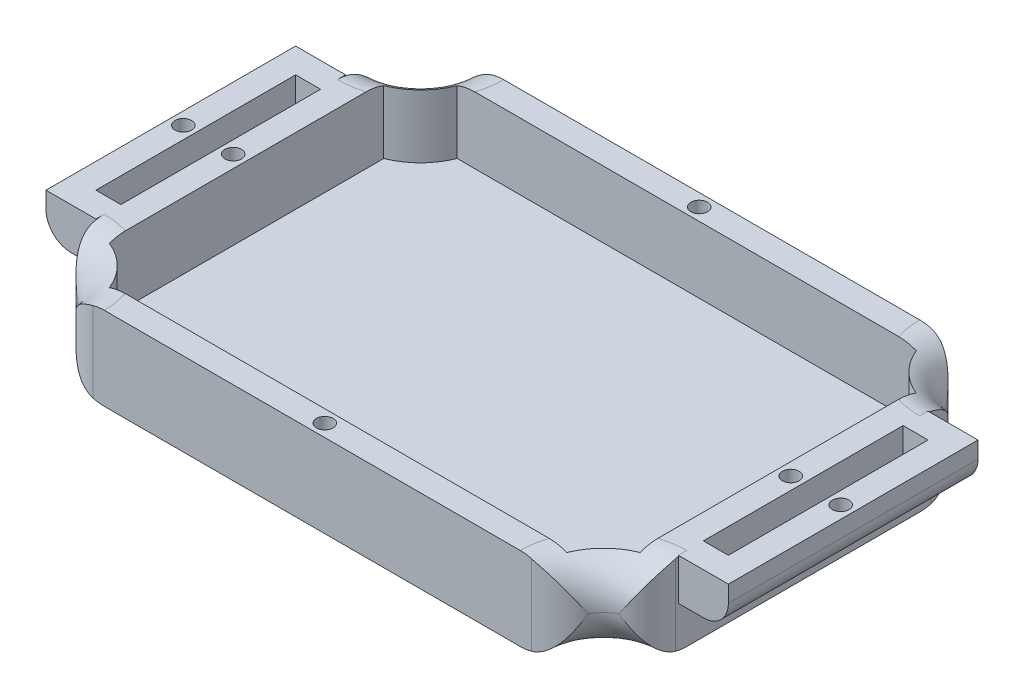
ISO-10303-21;
HEADER;
FILE_DESCRIPTION(('STEP AP214'),'2;1');
FILE_NAME('part.step','',(''),(''),'','','');
FILE_SCHEMA(('AUTOMOTIVE_DESIGN { 1 0 10303 214 1 1 1 1 }'));
ENDSEC;
DATA;
#1=APPLICATION_CONTEXT('core data for automotive mechanical design processes');
#2=APPLICATION_PROTOCOL_DEFINITION('international standard','automotive_design',2000,#1);
#3=PRODUCT_CONTEXT('',#1,'mechanical');
#4=PRODUCT('Part','Part','',(#3));
#5=PRODUCT_RELATED_PRODUCT_CATEGORY('part','',(#4));
#6=PRODUCT_DEFINITION_FORMATION('','',#4);
#7=PRODUCT_DEFINITION_CONTEXT('part definition',#1,'design');
#8=PRODUCT_DEFINITION('design','',#6,#7);
#9=PRODUCT_DEFINITION_SHAPE('','',#8);
#10=(LENGTH_UNIT() NAMED_UNIT(*) SI_UNIT(.MILLI.,.METRE.));
#11=(NAMED_UNIT(*) PLANE_ANGLE_UNIT() SI_UNIT($,.RADIAN.));
#12=(NAMED_UNIT(*) SI_UNIT($,.STERADIAN.) SOLID_ANGLE_UNIT());
#13=UNCERTAINTY_MEASURE_WITH_UNIT(LENGTH_MEASURE(1.E-05),#10,'distance_accuracy_value','');
#14=(GEOMETRIC_REPRESENTATION_CONTEXT(3) GLOBAL_UNCERTAINTY_ASSIGNED_CONTEXT((#13)) GLOBAL_UNIT_ASSIGNED_CONTEXT((#10,
#11,#12)) REPRESENTATION_CONTEXT('',''));
#15=CARTESIAN_POINT('',(0.,0.,0.));
#16=DIRECTION('',(0.,0.,1.));
#17=DIRECTION('',(1.,0.,0.));
#18=AXIS2_PLACEMENT_3D('',#15,#16,#17);
#19=CARTESIAN_POINT('',(0.,5.,0.));
#20=DIRECTION('',(0.,1.,0.));
#21=DIRECTION('',(0.,0.,1.));
#22=AXIS2_PLACEMENT_3D('',#19,#20,#21);
#23=PLANE('',#22);
#24=DIRECTION('',(-1.,0.,0.));
#25=VECTOR('',#24,1.);
#26=CARTESIAN_POINT('',(0.,5.,15.));
#27=LINE('',#26,#25);
#28=CARTESIAN_POINT('',(-35.,5.,15.));
#29=VERTEX_POINT('',#28);
#30=CARTESIAN_POINT('',(-38.,5.,15.));
#31=VERTEX_POINT('',#30);
#32=EDGE_CURVE('E466',#29,#31,#27,.T.);
#33=ORIENTED_EDGE('',*,*,#32,.T.);
#34=DIRECTION('',(0.,0.,1.));
#35=VECTOR('',#34,1.);
#36=CARTESIAN_POINT('',(-38.,5.,-15.));
#37=LINE('',#36,#35);
#38=CARTESIAN_POINT('',(-38.,5.,12.));
#39=VERTEX_POINT('',#38);
#40=EDGE_CURVE('E43',#31,#39,#37,.F.);
#41=ORIENTED_EDGE('',*,*,#40,.T.);
#42=DIRECTION('',(-1.,0.,0.));
#43=VECTOR('',#42,1.);
#44=CARTESIAN_POINT('',(0.,5.,12.));
#45=LINE('',#44,#43);
#46=CARTESIAN_POINT('',(-35.,5.,12.));
#47=VERTEX_POINT('',#46);
#48=EDGE_CURVE('E468',#47,#39,#45,.T.);
#49=ORIENTED_EDGE('',*,*,#48,.F.);
#50=DIRECTION('',(0.,0.,1.));
#51=VECTOR('',#50,1.);
#52=CARTESIAN_POINT('',(-35.,5.,0.));
#53=LINE('',#52,#51);
#54=EDGE_CURVE('E464',#47,#29,#53,.T.);
#55=ORIENTED_EDGE('',*,*,#54,.T.);
#56=EDGE_LOOP('',(#33,#41,#49,#55));
#57=FACE_BOUND('',#56,.T.);
#58=ADVANCED_FACE('F35',(#57),#23,.F.);
#59=CARTESIAN_POINT('',(0.,5.,0.));
#60=DIRECTION('',(0.,1.,0.));
#61=DIRECTION('',(0.,0.,1.));
#62=AXIS2_PLACEMENT_3D('',#59,#60,#61);
#63=PLANE('',#62);
#64=DIRECTION('',(-1.,0.,0.));
#65=VECTOR('',#64,1.);
#66=CARTESIAN_POINT('',(0.,5.,-15.));
#67=LINE('',#66,#65);
#68=CARTESIAN_POINT('',(38.,5.,-15.));
#69=VERTEX_POINT('',#68);
#70=CARTESIAN_POINT('',(35.,5.,-15.));
#71=VERTEX_POINT('',#70);
#72=EDGE_CURVE('E384',#69,#71,#67,.T.);
#73=ORIENTED_EDGE('',*,*,#72,.F.);
#74=DIRECTION('',(0.,0.,1.));
#75=VECTOR('',#74,1.);
#76=CARTESIAN_POINT('',(38.,5.,0.));
#77=LINE('',#76,#75);
#78=CARTESIAN_POINT('',(38.,5.,-12.));
#79=VERTEX_POINT('',#78);
#80=EDGE_CURVE('E370',#69,#79,#77,.T.);
#81=ORIENTED_EDGE('',*,*,#80,.T.);
#82=DIRECTION('',(1.,0.,0.));
#83=VECTOR('',#82,1.);
#84=CARTESIAN_POINT('',(0.,5.,-12.));
#85=LINE('',#84,#83);
#86=CARTESIAN_POINT('',(35.,5.,-12.));
#87=VERTEX_POINT('',#86);
#88=EDGE_CURVE('E376',#87,#79,#85,.T.);
#89=ORIENTED_EDGE('',*,*,#88,.F.);
#90=DIRECTION('',(0.,0.,1.));
#91=VECTOR('',#90,1.);
#92=CARTESIAN_POINT('',(35.,5.,0.));
#93=LINE('',#92,#91);
#94=EDGE_CURVE('E396',#71,#87,#93,.T.);
#95=ORIENTED_EDGE('',*,*,#94,.F.);
#96=EDGE_LOOP('',(#73,#81,#89,#95));
#97=FACE_BOUND('',#96,.T.);
#98=ADVANCED_FACE('F381',(#97),#63,.F.);
#99=CARTESIAN_POINT('',(35.,10.,-19.));
#100=DIRECTION('',(-1.,0.,0.));
#101=DIRECTION('',(0.,0.,1.));
#102=AXIS2_PLACEMENT_3D('',#99,#100,#101);
#103=PLANE('',#102);
#104=DIRECTION('',(0.,1.,0.));
#105=VECTOR('',#104,1.);
#106=CARTESIAN_POINT('',(35.,5.,15.));
#107=LINE('',#106,#105);
#108=CARTESIAN_POINT('',(35.,5.,15.));
#109=VERTEX_POINT('',#108);
#110=CARTESIAN_POINT('',(35.,9.89897948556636,15.));
#111=VERTEX_POINT('',#110);
#112=EDGE_CURVE('E446',#109,#111,#107,.T.);
#113=ORIENTED_EDGE('',*,*,#112,.T.);
#114=CARTESIAN_POINT('',(35.,5.,14.));
#115=DIRECTION('',(-1.,0.,0.));
#116=DIRECTION('',(0.,0.,1.));
#117=AXIS2_PLACEMENT_3D('',#114,#115,#116);
#118=CIRCLE('',#117,5.);
#119=CARTESIAN_POINT('',(35.,9.81716522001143,15.3397459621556));
#120=VERTEX_POINT('',#119);
#121=EDGE_CURVE('E626',#111,#120,#118,.F.);
#122=ORIENTED_EDGE('',*,*,#121,.T.);
#123=DIRECTION('',(0.,-1.,0.));
#124=VECTOR('',#123,1.);
#125=CARTESIAN_POINT('',(35.,10.,15.3397459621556));
#126=LINE('',#125,#124);
#127=CARTESIAN_POINT('',(35.,0.182834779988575,15.3397459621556));
#128=VERTEX_POINT('',#127);
#129=EDGE_CURVE('E624',#120,#128,#126,.T.);
#130=ORIENTED_EDGE('',*,*,#129,.T.);
#131=CARTESIAN_POINT('',(35.,5.,14.));
#132=DIRECTION('',(-1.,0.,0.));
#133=DIRECTION('',(0.,0.,1.));
#134=AXIS2_PLACEMENT_3D('',#131,#132,#133);
#135=CIRCLE('',#134,5.);
#136=CARTESIAN_POINT('',(35.,0.,14.));
#137=VERTEX_POINT('',#136);
#138=EDGE_CURVE('E612',#128,#137,#135,.F.);
#139=ORIENTED_EDGE('',*,*,#138,.T.);
#140=DIRECTION('',(0.,0.,-1.));
#141=VECTOR('',#140,1.);
#142=CARTESIAN_POINT('',(35.,0.,-19.));
#143=LINE('',#142,#141);
#144=CARTESIAN_POINT('',(35.,0.,-14.));
#145=VERTEX_POINT('',#144);
#146=EDGE_CURVE('E603',#137,#145,#143,.T.);
#147=ORIENTED_EDGE('',*,*,#146,.T.);
#148=CARTESIAN_POINT('',(35.,5.,-14.));
#149=DIRECTION('',(-1.,0.,0.));
#150=DIRECTION('',(0.,0.,1.));
#151=AXIS2_PLACEMENT_3D('',#148,#149,#150);
#152=CIRCLE('',#151,5.);
#153=CARTESIAN_POINT('',(35.,0.182834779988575,-15.3397459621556));
#154=VERTEX_POINT('',#153);
#155=EDGE_CURVE('E630',#145,#154,#152,.F.);
#156=ORIENTED_EDGE('',*,*,#155,.T.);
#157=DIRECTION('',(0.,-1.,0.));
#158=VECTOR('',#157,1.);
#159=CARTESIAN_POINT('',(35.,10.,-15.3397459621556));
#160=LINE('',#159,#158);
#161=CARTESIAN_POINT('',(35.,9.81716522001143,-15.3397459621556));
#162=VERTEX_POINT('',#161);
#163=EDGE_CURVE('E632',#154,#162,#160,.F.);
#164=ORIENTED_EDGE('',*,*,#163,.T.);
#165=CARTESIAN_POINT('',(35.,5.,-14.));
#166=DIRECTION('',(-1.,0.,0.));
#167=DIRECTION('',(0.,0.,1.));
#168=AXIS2_PLACEMENT_3D('',#165,#166,#167);
#169=CIRCLE('',#168,5.);
#170=CARTESIAN_POINT('',(35.,9.89897948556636,-15.));
#171=VERTEX_POINT('',#170);
#172=EDGE_CURVE('E636',#162,#171,#169,.F.);
#173=ORIENTED_EDGE('',*,*,#172,.T.);
#174=DIRECTION('',(0.,1.,0.));
#175=VECTOR('',#174,1.);
#176=CARTESIAN_POINT('',(35.,5.,-15.));
#177=LINE('',#176,#175);
#178=EDGE_CURVE('E438',#71,#171,#177,.T.);
#179=ORIENTED_EDGE('',*,*,#178,.F.);
#180=ORIENTED_EDGE('',*,*,#94,.T.);
#181=DIRECTION('',(0.,1.,0.));
#182=VECTOR('',#181,1.);
#183=CARTESIAN_POINT('',(35.,5.,-12.));
#184=LINE('',#183,#182);
#185=CARTESIAN_POINT('',(35.,10.,-12.));
#186=VERTEX_POINT('',#185);
#187=EDGE_CURVE('E400',#87,#186,#184,.T.);
#188=ORIENTED_EDGE('',*,*,#187,.T.);
#189=DIRECTION('',(0.,0.,-1.));
#190=VECTOR('',#189,1.);
#191=CARTESIAN_POINT('',(35.,10.,-19.));
#192=LINE('',#191,#190);
#193=CARTESIAN_POINT('',(35.,10.,12.));
#194=VERTEX_POINT('',#193);
#195=EDGE_CURVE('E609',#194,#186,#192,.T.);
#196=ORIENTED_EDGE('',*,*,#195,.F.);
#197=DIRECTION('',(0.,1.,0.));
#198=VECTOR('',#197,1.);
#199=CARTESIAN_POINT('',(35.,5.,12.));
#200=LINE('',#199,#198);
#201=CARTESIAN_POINT('',(35.,5.,12.));
#202=VERTEX_POINT('',#201);
#203=EDGE_CURVE('E450',#202,#194,#200,.T.);
#204=ORIENTED_EDGE('',*,*,#203,.F.);
#205=DIRECTION('',(0.,0.,-1.));
#206=VECTOR('',#205,1.);
#207=CARTESIAN_POINT('',(35.,5.,0.));
#208=LINE('',#207,#206);
#209=EDGE_CURVE('E411',#109,#202,#208,.T.);
#210=ORIENTED_EDGE('',*,*,#209,.F.);
#211=EDGE_LOOP('',(#113,#122,#130,#139,#147,#156,#164,#173,#179,#180,#188,#196,#204,#210));
#212=FACE_BOUND('',#211,.T.);
#213=ADVANCED_FACE('F1085',(#212),#103,.F.);
#214=CARTESIAN_POINT('',(35.,10.,-24.));
#215=DIRECTION('',(0.,1.,0.));
#216=DIRECTION('',(0.,0.,1.));
#217=AXIS2_PLACEMENT_3D('',#214,#215,#216);
#218=PLANE('',#217);
#219=CARTESIAN_POINT('',(39.5,10.,0.));
#220=DIRECTION('',(0.,1.,0.));
#221=DIRECTION('',(0.,0.,1.));
#222=AXIS2_PLACEMENT_3D('',#219,#220,#221);
#223=CIRCLE('',#222,0.999999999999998);
#224=CARTESIAN_POINT('',(39.5,10.,0.999999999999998));
#225=VERTEX_POINT('',#224);
#226=EDGE_CURVE('E407',#225,#225,#223,.T.);
#227=ORIENTED_EDGE('',*,*,#226,.F.);
#228=EDGE_LOOP('',(#227));
#229=FACE_BOUND('',#228,.T.);
#230=DIRECTION('',(1.,0.,0.));
#231=VECTOR('',#230,1.);
#232=CARTESIAN_POINT('',(0.,10.,12.));
#233=LINE('',#232,#231);
#234=CARTESIAN_POINT('',(38.,10.,12.));
#235=VERTEX_POINT('',#234);
#236=EDGE_CURVE('E422',#194,#235,#233,.T.);
#237=ORIENTED_EDGE('',*,*,#236,.F.);
#238=ORIENTED_EDGE('',*,*,#195,.T.);
#239=DIRECTION('',(1.,0.,0.));
#240=VECTOR('',#239,1.);
#241=CARTESIAN_POINT('',(0.,10.,-12.));
#242=LINE('',#241,#240);
#243=CARTESIAN_POINT('',(38.,10.,-12.));
#244=VERTEX_POINT('',#243);
#245=EDGE_CURVE('E418',#186,#244,#242,.T.);
#246=ORIENTED_EDGE('',*,*,#245,.T.);
#247=DIRECTION('',(0.,0.,1.));
#248=VECTOR('',#247,1.);
#249=CARTESIAN_POINT('',(38.,10.,0.));
#250=LINE('',#249,#248);
#251=EDGE_CURVE('E391',#244,#235,#250,.T.);
#252=ORIENTED_EDGE('',*,*,#251,.T.);
#253=EDGE_LOOP('',(#237,#238,#246,#252));
#254=FACE_BOUND('',#253,.T.);
#255=CARTESIAN_POINT('',(33.5,10.,0.));
#256=DIRECTION('',(0.,1.,0.));
#257=DIRECTION('',(0.,0.,1.));
#258=AXIS2_PLACEMENT_3D('',#255,#256,#257);
#259=CIRCLE('',#258,0.999999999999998);
#260=CARTESIAN_POINT('',(33.5,10.,0.999999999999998));
#261=VERTEX_POINT('',#260);
#262=EDGE_CURVE('E529',#261,#261,#259,.T.);
#263=ORIENTED_EDGE('',*,*,#262,.F.);
#264=EDGE_LOOP('',(#263));
#265=FACE_BOUND('',#264,.T.);
#266=CARTESIAN_POINT('',(35.,10.,24.));
#267=DIRECTION('',(0.,1.,0.));
#268=DIRECTION('',(0.,0.,1.));
#269=AXIS2_PLACEMENT_3D('',#266,#267,#268);
#270=CIRCLE('',#269,10.);
#271=CARTESIAN_POINT('',(32.,10.,14.4606079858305));
#272=VERTEX_POINT('',#271);
#273=CARTESIAN_POINT('',(35.,10.,14.));
#274=VERTEX_POINT('',#273);
#275=EDGE_CURVE('E643',#272,#274,#270,.F.);
#276=ORIENTED_EDGE('',*,*,#275,.T.);
#277=DIRECTION('',(0.,0.,-1.));
#278=VECTOR('',#277,1.);
#279=CARTESIAN_POINT('',(35.,10.,0.));
#280=LINE('',#279,#278);
#281=CARTESIAN_POINT('',(35.,10.,15.));
#282=VERTEX_POINT('',#281);
#283=EDGE_CURVE('E425',#282,#274,#280,.T.);
#284=ORIENTED_EDGE('',*,*,#283,.F.);
#285=DIRECTION('',(-1.,0.,0.));
#286=VECTOR('',#285,1.);
#287=CARTESIAN_POINT('',(0.,10.,15.));
#288=LINE('',#287,#286);
#289=CARTESIAN_POINT('',(41.,10.,15.));
#290=VERTEX_POINT('',#289);
#291=EDGE_CURVE('E428',#290,#282,#288,.T.);
#292=ORIENTED_EDGE('',*,*,#291,.F.);
#293=DIRECTION('',(0.,0.,1.));
#294=VECTOR('',#293,1.);
#295=CARTESIAN_POINT('',(41.,10.,0.));
#296=LINE('',#295,#294);
#297=CARTESIAN_POINT('',(41.,10.,-15.));
#298=VERTEX_POINT('',#297);
#299=EDGE_CURVE('E431',#298,#290,#296,.T.);
#300=ORIENTED_EDGE('',*,*,#299,.F.);
#301=DIRECTION('',(-1.,0.,0.));
#302=VECTOR('',#301,1.);
#303=CARTESIAN_POINT('',(0.,10.,-15.));
#304=LINE('',#303,#302);
#305=CARTESIAN_POINT('',(35.,10.,-15.));
#306=VERTEX_POINT('',#305);
#307=EDGE_CURVE('E404',#298,#306,#304,.T.);
#308=ORIENTED_EDGE('',*,*,#307,.T.);
#309=DIRECTION('',(0.,0.,1.));
#310=VECTOR('',#309,1.);
#311=CARTESIAN_POINT('',(35.,10.,0.));
#312=LINE('',#311,#310);
#313=CARTESIAN_POINT('',(35.,10.,-14.));
#314=VERTEX_POINT('',#313);
#315=EDGE_CURVE('E401',#306,#314,#312,.T.);
#316=ORIENTED_EDGE('',*,*,#315,.T.);
#317=CARTESIAN_POINT('',(35.,10.,-24.));
#318=DIRECTION('',(0.,1.,0.));
#319=DIRECTION('',(0.,0.,1.));
#320=AXIS2_PLACEMENT_3D('',#317,#318,#319);
#321=CIRCLE('',#320,10.);
#322=CARTESIAN_POINT('',(32.,10.,-14.4606079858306));
#323=VERTEX_POINT('',#322);
#324=EDGE_CURVE('E653',#314,#323,#321,.F.);
#325=ORIENTED_EDGE('',*,*,#324,.T.);
#326=DIRECTION('',(0.,0.,-1.));
#327=VECTOR('',#326,1.);
#328=CARTESIAN_POINT('',(32.,10.,-16.5838015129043));
#329=LINE('',#328,#327);
#330=EDGE_CURVE('E541',#272,#323,#329,.T.);
#331=ORIENTED_EDGE('',*,*,#330,.F.);
#332=EDGE_LOOP('',(#276,#284,#292,#300,#308,#316,#325,#331));
#333=FACE_BOUND('',#332,.T.);
#334=ADVANCED_FACE('F1076',(#229,#254,#265,#333),#218,.T.);
#335=CARTESIAN_POINT('',(0.,10.,-22.5));
#336=DIRECTION('',(0.,1.,0.));
#337=DIRECTION('',(0.,0.,1.));
#338=AXIS2_PLACEMENT_3D('',#335,#336,#337);
#339=CIRCLE('',#338,1.);
#340=CARTESIAN_POINT('',(0.,10.,-21.5));
#341=VERTEX_POINT('',#340);
#342=EDGE_CURVE('E523',#341,#341,#339,.T.);
#343=ORIENTED_EDGE('',*,*,#342,.F.);
#344=EDGE_LOOP('',(#343));
#345=FACE_BOUND('',#344,.T.);
#346=DIRECTION('',(-1.,0.,0.));
#347=VECTOR('',#346,1.);
#348=CARTESIAN_POINT('',(-27.5838015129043,10.,-21.));
#349=LINE('',#348,#347);
#350=CARTESIAN_POINT('',(25.4606079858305,10.,-21.));
#351=VERTEX_POINT('',#350);
#352=CARTESIAN_POINT('',(-25.4606079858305,10.,-21.));
#353=VERTEX_POINT('',#352);
#354=EDGE_CURVE('E563',#351,#353,#349,.T.);
#355=ORIENTED_EDGE('',*,*,#354,.F.);
#356=CARTESIAN_POINT('',(35.,10.,-24.));
#357=DIRECTION('',(0.,1.,0.));
#358=DIRECTION('',(0.,0.,1.));
#359=AXIS2_PLACEMENT_3D('',#356,#357,#358);
#360=CIRCLE('',#359,10.);
#361=CARTESIAN_POINT('',(25.,10.,-24.));
#362=VERTEX_POINT('',#361);
#363=EDGE_CURVE('E651',#351,#362,#360,.F.);
#364=ORIENTED_EDGE('',*,*,#363,.T.);
#365=DIRECTION('',(-1.,0.,0.));
#366=VECTOR('',#365,1.);
#367=CARTESIAN_POINT('',(30.,10.,-24.));
#368=LINE('',#367,#366);
#369=CARTESIAN_POINT('',(-25.,10.,-24.));
#370=VERTEX_POINT('',#369);
#371=EDGE_CURVE('E599',#362,#370,#368,.T.);
#372=ORIENTED_EDGE('',*,*,#371,.T.);
#373=CARTESIAN_POINT('',(-35.,10.,-24.));
#374=DIRECTION('',(0.,1.,0.));
#375=DIRECTION('',(0.,0.,1.));
#376=AXIS2_PLACEMENT_3D('',#373,#374,#375);
#377=CIRCLE('',#376,10.);
#378=EDGE_CURVE('E649',#370,#353,#377,.F.);
#379=ORIENTED_EDGE('',*,*,#378,.T.);
#380=EDGE_LOOP('',(#355,#364,#372,#379));
#381=FACE_BOUND('',#380,.T.);
#382=ADVANCED_FACE('F1060',(#345,#381),#218,.T.);
#383=CARTESIAN_POINT('',(0.,10.,22.5));
#384=DIRECTION('',(0.,1.,0.));
#385=DIRECTION('',(0.,0.,1.));
#386=AXIS2_PLACEMENT_3D('',#383,#384,#385);
#387=CIRCLE('',#386,1.);
#388=CARTESIAN_POINT('',(0.,10.,23.5));
#389=VERTEX_POINT('',#388);
#390=EDGE_CURVE('E493',#389,#389,#387,.T.);
#391=ORIENTED_EDGE('',*,*,#390,.F.);
#392=EDGE_LOOP('',(#391));
#393=FACE_BOUND('',#392,.T.);
#394=DIRECTION('',(1.,0.,0.));
#395=VECTOR('',#394,1.);
#396=CARTESIAN_POINT('',(30.,10.,24.));
#397=LINE('',#396,#395);
#398=CARTESIAN_POINT('',(-25.,10.,24.));
#399=VERTEX_POINT('',#398);
#400=CARTESIAN_POINT('',(25.,10.,24.));
#401=VERTEX_POINT('',#400);
#402=EDGE_CURVE('E606',#399,#401,#397,.T.);
#403=ORIENTED_EDGE('',*,*,#402,.T.);
#404=CARTESIAN_POINT('',(35.,10.,24.));
#405=DIRECTION('',(0.,1.,0.));
#406=DIRECTION('',(0.,0.,1.));
#407=AXIS2_PLACEMENT_3D('',#404,#405,#406);
#408=CIRCLE('',#407,10.);
#409=CARTESIAN_POINT('',(25.4606079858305,10.,21.));
#410=VERTEX_POINT('',#409);
#411=EDGE_CURVE('E645',#401,#410,#408,.F.);
#412=ORIENTED_EDGE('',*,*,#411,.T.);
#413=DIRECTION('',(1.,0.,0.));
#414=VECTOR('',#413,1.);
#415=CARTESIAN_POINT('',(-27.3874291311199,10.,21.));
#416=LINE('',#415,#414);
#417=CARTESIAN_POINT('',(-25.4606079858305,10.,21.));
#418=VERTEX_POINT('',#417);
#419=EDGE_CURVE('E570',#418,#410,#416,.T.);
#420=ORIENTED_EDGE('',*,*,#419,.F.);
#421=CARTESIAN_POINT('',(-35.,10.,24.));
#422=DIRECTION('',(0.,1.,0.));
#423=DIRECTION('',(0.,0.,1.));
#424=AXIS2_PLACEMENT_3D('',#421,#422,#423);
#425=CIRCLE('',#424,10.);
#426=EDGE_CURVE('E639',#418,#399,#425,.F.);
#427=ORIENTED_EDGE('',*,*,#426,.T.);
#428=EDGE_LOOP('',(#403,#412,#420,#427));
#429=FACE_BOUND('',#428,.T.);
#430=ADVANCED_FACE('F951',(#393,#429),#218,.T.);
#431=CARTESIAN_POINT('',(30.,10.,-24.));
#432=DIRECTION('',(0.,0.,1.));
#433=DIRECTION('',(1.,0.,0.));
#434=AXIS2_PLACEMENT_3D('',#431,#432,#433);
#435=PLANE('',#434);
#436=ORIENTED_EDGE('',*,*,#371,.F.);
#437=CARTESIAN_POINT('',(25.,5.,-24.));
#438=DIRECTION('',(0.,0.,1.));
#439=DIRECTION('',(1.,0.,0.));
#440=AXIS2_PLACEMENT_3D('',#437,#438,#439);
#441=CIRCLE('',#440,5.);
#442=CARTESIAN_POINT('',(26.3397459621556,9.81716522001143,-24.));
#443=VERTEX_POINT('',#442);
#444=EDGE_CURVE('E976',#362,#443,#441,.F.);
#445=ORIENTED_EDGE('',*,*,#444,.T.);
#446=DIRECTION('',(0.,-1.,0.));
#447=VECTOR('',#446,1.);
#448=CARTESIAN_POINT('',(26.3397459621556,10.,-24.));
#449=LINE('',#448,#447);
#450=CARTESIAN_POINT('',(26.3397459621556,0.182834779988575,-24.));
#451=VERTEX_POINT('',#450);
#452=EDGE_CURVE('E1030',#443,#451,#449,.T.);
#453=ORIENTED_EDGE('',*,*,#452,.T.);
#454=CARTESIAN_POINT('',(25.,5.,-24.));
#455=DIRECTION('',(0.,0.,1.));
#456=DIRECTION('',(1.,0.,0.));
#457=AXIS2_PLACEMENT_3D('',#454,#455,#456);
#458=CIRCLE('',#457,5.);
#459=CARTESIAN_POINT('',(25.,0.,-24.));
#460=VERTEX_POINT('',#459);
#461=EDGE_CURVE('E1028',#451,#460,#458,.F.);
#462=ORIENTED_EDGE('',*,*,#461,.T.);
#463=DIRECTION('',(-1.,0.,0.));
#464=VECTOR('',#463,1.);
#465=CARTESIAN_POINT('',(30.,0.,-24.));
#466=LINE('',#465,#464);
#467=CARTESIAN_POINT('',(-25.,0.,-24.));
#468=VERTEX_POINT('',#467);
#469=EDGE_CURVE('E578',#460,#468,#466,.T.);
#470=ORIENTED_EDGE('',*,*,#469,.T.);
#471=CARTESIAN_POINT('',(-25.,5.,-24.));
#472=DIRECTION('',(0.,0.,1.));
#473=DIRECTION('',(1.,0.,0.));
#474=AXIS2_PLACEMENT_3D('',#471,#472,#473);
#475=CIRCLE('',#474,5.);
#476=CARTESIAN_POINT('',(-26.3397459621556,0.182834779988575,-24.));
#477=VERTEX_POINT('',#476);
#478=EDGE_CURVE('E1021',#468,#477,#475,.F.);
#479=ORIENTED_EDGE('',*,*,#478,.T.);
#480=DIRECTION('',(0.,-1.,0.));
#481=VECTOR('',#480,1.);
#482=CARTESIAN_POINT('',(-26.3397459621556,10.,-24.));
#483=LINE('',#482,#481);
#484=CARTESIAN_POINT('',(-26.3397459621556,9.81716522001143,-24.));
#485=VERTEX_POINT('',#484);
#486=EDGE_CURVE('E1023',#477,#485,#483,.F.);
#487=ORIENTED_EDGE('',*,*,#486,.T.);
#488=CARTESIAN_POINT('',(-25.,5.,-24.));
#489=DIRECTION('',(0.,0.,1.));
#490=DIRECTION('',(1.,0.,0.));
#491=AXIS2_PLACEMENT_3D('',#488,#489,#490);
#492=CIRCLE('',#491,5.);
#493=EDGE_CURVE('E1026',#485,#370,#492,.F.);
#494=ORIENTED_EDGE('',*,*,#493,.T.);
#495=EDGE_LOOP('',(#436,#445,#453,#462,#470,#479,#487,#494));
#496=FACE_BOUND('',#495,.T.);
#497=ADVANCED_FACE('F1035',(#496),#435,.F.);
#498=CARTESIAN_POINT('',(-35.,10.,-19.));
#499=DIRECTION('',(1.,0.,0.));
#500=DIRECTION('',(0.,0.,-1.));
#501=AXIS2_PLACEMENT_3D('',#498,#499,#500);
#502=PLANE('',#501);
#503=CARTESIAN_POINT('',(-35.,5.,-15.));
#504=VERTEX_POINT('',#503);
#505=CARTESIAN_POINT('',(-35.,5.,-12.));
#506=VERTEX_POINT('',#505);
#507=EDGE_CURVE('E460',#504,#506,#53,.T.);
#508=ORIENTED_EDGE('',*,*,#507,.F.);
#509=DIRECTION('',(0.,1.,0.));
#510=VECTOR('',#509,1.);
#511=CARTESIAN_POINT('',(-35.,5.,-15.));
#512=LINE('',#511,#510);
#513=CARTESIAN_POINT('',(-35.,9.89897948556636,-15.));
#514=VERTEX_POINT('',#513);
#515=EDGE_CURVE('E504',#504,#514,#512,.T.);
#516=ORIENTED_EDGE('',*,*,#515,.T.);
#517=CARTESIAN_POINT('',(-35.,5.,-14.));
#518=DIRECTION('',(1.,0.,0.));
#519=DIRECTION('',(0.,0.,-1.));
#520=AXIS2_PLACEMENT_3D('',#517,#518,#519);
#521=CIRCLE('',#520,5.);
#522=CARTESIAN_POINT('',(-35.,9.81716522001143,-15.3397459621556));
#523=VERTEX_POINT('',#522);
#524=EDGE_CURVE('E924',#514,#523,#521,.F.);
#525=ORIENTED_EDGE('',*,*,#524,.T.);
#526=DIRECTION('',(0.,-1.,0.));
#527=VECTOR('',#526,1.);
#528=CARTESIAN_POINT('',(-35.,10.,-15.3397459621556));
#529=LINE('',#528,#527);
#530=CARTESIAN_POINT('',(-35.,0.182834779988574,-15.3397459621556));
#531=VERTEX_POINT('',#530);
#532=EDGE_CURVE('E928',#523,#531,#529,.T.);
#533=ORIENTED_EDGE('',*,*,#532,.T.);
#534=CARTESIAN_POINT('',(-35.,5.,-14.));
#535=DIRECTION('',(1.,0.,0.));
#536=DIRECTION('',(0.,0.,-1.));
#537=AXIS2_PLACEMENT_3D('',#534,#535,#536);
#538=CIRCLE('',#537,5.);
#539=CARTESIAN_POINT('',(-35.,0.,-14.));
#540=VERTEX_POINT('',#539);
#541=EDGE_CURVE('E1049',#531,#540,#538,.F.);
#542=ORIENTED_EDGE('',*,*,#541,.T.);
#543=DIRECTION('',(0.,0.,1.));
#544=VECTOR('',#543,1.);
#545=CARTESIAN_POINT('',(-35.,0.,-19.));
#546=LINE('',#545,#544);
#547=CARTESIAN_POINT('',(-35.,0.,14.));
#548=VERTEX_POINT('',#547);
#549=EDGE_CURVE('E615',#540,#548,#546,.T.);
#550=ORIENTED_EDGE('',*,*,#549,.T.);
#551=CARTESIAN_POINT('',(-35.,5.,14.));
#552=DIRECTION('',(1.,0.,0.));
#553=DIRECTION('',(0.,0.,-1.));
#554=AXIS2_PLACEMENT_3D('',#551,#552,#553);
#555=CIRCLE('',#554,5.);
#556=CARTESIAN_POINT('',(-35.,0.182834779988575,15.3397459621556));
#557=VERTEX_POINT('',#556);
#558=EDGE_CURVE('E1132',#548,#557,#555,.F.);
#559=ORIENTED_EDGE('',*,*,#558,.T.);
#560=DIRECTION('',(0.,-1.,0.));
#561=VECTOR('',#560,1.);
#562=CARTESIAN_POINT('',(-35.,10.,15.3397459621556));
#563=LINE('',#562,#561);
#564=CARTESIAN_POINT('',(-35.,9.81716522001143,15.3397459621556));
#565=VERTEX_POINT('',#564);
#566=EDGE_CURVE('E1133',#557,#565,#563,.F.);
#567=ORIENTED_EDGE('',*,*,#566,.T.);
#568=CARTESIAN_POINT('',(-35.,5.,14.));
#569=DIRECTION('',(1.,0.,0.));
#570=DIRECTION('',(0.,0.,-1.));
#571=AXIS2_PLACEMENT_3D('',#568,#569,#570);
#572=CIRCLE('',#571,5.);
#573=CARTESIAN_POINT('',(-35.,9.89897948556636,15.));
#574=VERTEX_POINT('',#573);
#575=EDGE_CURVE('E1138',#565,#574,#572,.F.);
#576=ORIENTED_EDGE('',*,*,#575,.T.);
#577=DIRECTION('',(0.,1.,0.));
#578=VECTOR('',#577,1.);
#579=CARTESIAN_POINT('',(-35.,5.,15.));
#580=LINE('',#579,#578);
#581=EDGE_CURVE('E496',#29,#574,#580,.T.);
#582=ORIENTED_EDGE('',*,*,#581,.F.);
#583=ORIENTED_EDGE('',*,*,#54,.F.);
#584=DIRECTION('',(0.,1.,0.));
#585=VECTOR('',#584,1.);
#586=CARTESIAN_POINT('',(-35.,5.,12.));
#587=LINE('',#586,#585);
#588=CARTESIAN_POINT('',(-35.,10.,12.));
#589=VERTEX_POINT('',#588);
#590=EDGE_CURVE('E494',#47,#589,#587,.T.);
#591=ORIENTED_EDGE('',*,*,#590,.T.);
#592=DIRECTION('',(0.,0.,1.));
#593=VECTOR('',#592,1.);
#594=CARTESIAN_POINT('',(-35.,10.,-19.));
#595=LINE('',#594,#593);
#596=CARTESIAN_POINT('',(-35.,10.,-12.));
#597=VERTEX_POINT('',#596);
#598=EDGE_CURVE('E602',#597,#589,#595,.T.);
#599=ORIENTED_EDGE('',*,*,#598,.F.);
#600=DIRECTION('',(0.,1.,0.));
#601=VECTOR('',#600,1.);
#602=CARTESIAN_POINT('',(-35.,5.,-12.));
#603=LINE('',#602,#601);
#604=EDGE_CURVE('E508',#506,#597,#603,.T.);
#605=ORIENTED_EDGE('',*,*,#604,.F.);
#606=EDGE_LOOP('',(#508,#516,#525,#533,#542,#550,#559,#567,#576,#582,#583,#591,#599,#605));
#607=FACE_BOUND('',#606,.T.);
#608=ADVANCED_FACE('F1114',(#607),#502,.F.);
#609=CARTESIAN_POINT('',(30.,10.,24.));
#610=DIRECTION('',(0.,0.,-1.));
#611=DIRECTION('',(-1.,0.,0.));
#612=AXIS2_PLACEMENT_3D('',#609,#610,#611);
#613=PLANE('',#612);
#614=DIRECTION('',(0.,-1.,0.));
#615=VECTOR('',#614,1.);
#616=CARTESIAN_POINT('',(26.3397459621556,10.,24.));
#617=LINE('',#616,#615);
#618=CARTESIAN_POINT('',(26.3397459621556,0.182834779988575,24.));
#619=VERTEX_POINT('',#618);
#620=CARTESIAN_POINT('',(26.3397459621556,9.81716522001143,24.));
#621=VERTEX_POINT('',#620);
#622=EDGE_CURVE('E937',#619,#621,#617,.F.);
#623=ORIENTED_EDGE('',*,*,#622,.T.);
#624=CARTESIAN_POINT('',(25.,5.,24.));
#625=DIRECTION('',(0.,0.,-1.));
#626=DIRECTION('',(-1.,0.,0.));
#627=AXIS2_PLACEMENT_3D('',#624,#625,#626);
#628=CIRCLE('',#627,5.);
#629=EDGE_CURVE('E939',#621,#401,#628,.F.);
#630=ORIENTED_EDGE('',*,*,#629,.T.);
#631=ORIENTED_EDGE('',*,*,#402,.F.);
#632=CARTESIAN_POINT('',(-25.,5.,24.));
#633=DIRECTION('',(0.,0.,-1.));
#634=DIRECTION('',(-1.,0.,0.));
#635=AXIS2_PLACEMENT_3D('',#632,#633,#634);
#636=CIRCLE('',#635,5.);
#637=CARTESIAN_POINT('',(-26.3397459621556,9.81716522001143,24.));
#638=VERTEX_POINT('',#637);
#639=EDGE_CURVE('E933',#399,#638,#636,.F.);
#640=ORIENTED_EDGE('',*,*,#639,.T.);
#641=DIRECTION('',(0.,-1.,0.));
#642=VECTOR('',#641,1.);
#643=CARTESIAN_POINT('',(-26.3397459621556,10.,24.));
#644=LINE('',#643,#642);
#645=CARTESIAN_POINT('',(-26.3397459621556,0.182834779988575,24.));
#646=VERTEX_POINT('',#645);
#647=EDGE_CURVE('E926',#638,#646,#644,.T.);
#648=ORIENTED_EDGE('',*,*,#647,.T.);
#649=CARTESIAN_POINT('',(-25.,5.,24.));
#650=DIRECTION('',(0.,0.,-1.));
#651=DIRECTION('',(-1.,0.,0.));
#652=AXIS2_PLACEMENT_3D('',#649,#650,#651);
#653=CIRCLE('',#652,5.);
#654=CARTESIAN_POINT('',(-25.,0.,24.));
#655=VERTEX_POINT('',#654);
#656=EDGE_CURVE('E923',#646,#655,#653,.F.);
#657=ORIENTED_EDGE('',*,*,#656,.T.);
#658=DIRECTION('',(1.,0.,0.));
#659=VECTOR('',#658,1.);
#660=CARTESIAN_POINT('',(30.,0.,24.));
#661=LINE('',#660,#659);
#662=CARTESIAN_POINT('',(25.,0.,24.));
#663=VERTEX_POINT('',#662);
#664=EDGE_CURVE('E618',#655,#663,#661,.T.);
#665=ORIENTED_EDGE('',*,*,#664,.T.);
#666=CARTESIAN_POINT('',(25.,5.,24.));
#667=DIRECTION('',(0.,0.,-1.));
#668=DIRECTION('',(-1.,0.,0.));
#669=AXIS2_PLACEMENT_3D('',#666,#667,#668);
#670=CIRCLE('',#669,5.);
#671=EDGE_CURVE('E935',#663,#619,#670,.F.);
#672=ORIENTED_EDGE('',*,*,#671,.T.);
#673=EDGE_LOOP('',(#623,#630,#631,#640,#648,#657,#665,#672));
#674=FACE_BOUND('',#673,.T.);
#675=ADVANCED_FACE('F956',(#674),#613,.F.);
#676=CARTESIAN_POINT('',(-39.5,10.,0.));
#677=DIRECTION('',(0.,1.,0.));
#678=DIRECTION('',(0.,0.,1.));
#679=AXIS2_PLACEMENT_3D('',#676,#677,#678);
#680=CIRCLE('',#679,0.999999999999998);
#681=CARTESIAN_POINT('',(-39.5,10.,0.999999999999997));
#682=VERTEX_POINT('',#681);
#683=EDGE_CURVE('E1689',#682,#682,#680,.T.);
#684=ORIENTED_EDGE('',*,*,#683,.F.);
#685=EDGE_LOOP('',(#684));
#686=FACE_BOUND('',#685,.T.);
#687=DIRECTION('',(0.,0.,1.));
#688=VECTOR('',#687,1.);
#689=CARTESIAN_POINT('',(-35.,10.,0.));
#690=LINE('',#689,#688);
#691=CARTESIAN_POINT('',(-35.,10.,14.));
#692=VERTEX_POINT('',#691);
#693=CARTESIAN_POINT('',(-35.,10.,15.));
#694=VERTEX_POINT('',#693);
#695=EDGE_CURVE('E480',#692,#694,#690,.T.);
#696=ORIENTED_EDGE('',*,*,#695,.F.);
#697=CARTESIAN_POINT('',(-35.,10.,24.));
#698=DIRECTION('',(0.,1.,0.));
#699=DIRECTION('',(0.,0.,1.));
#700=AXIS2_PLACEMENT_3D('',#697,#698,#699);
#701=CIRCLE('',#700,10.);
#702=CARTESIAN_POINT('',(-32.,10.,14.4606079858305));
#703=VERTEX_POINT('',#702);
#704=EDGE_CURVE('E641',#692,#703,#701,.F.);
#705=ORIENTED_EDGE('',*,*,#704,.T.);
#706=DIRECTION('',(0.,0.,1.));
#707=VECTOR('',#706,1.);
#708=CARTESIAN_POINT('',(-32.,10.,-16.5838015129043));
#709=LINE('',#708,#707);
#710=CARTESIAN_POINT('',(-32.,10.,-14.4606079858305));
#711=VERTEX_POINT('',#710);
#712=EDGE_CURVE('E566',#711,#703,#709,.T.);
#713=ORIENTED_EDGE('',*,*,#712,.F.);
#714=CARTESIAN_POINT('',(-35.,10.,-24.));
#715=DIRECTION('',(0.,1.,0.));
#716=DIRECTION('',(0.,0.,1.));
#717=AXIS2_PLACEMENT_3D('',#714,#715,#716);
#718=CIRCLE('',#717,10.);
#719=CARTESIAN_POINT('',(-35.,10.,-14.));
#720=VERTEX_POINT('',#719);
#721=EDGE_CURVE('E647',#711,#720,#718,.F.);
#722=ORIENTED_EDGE('',*,*,#721,.T.);
#723=CARTESIAN_POINT('',(-35.,10.,-15.));
#724=VERTEX_POINT('',#723);
#725=EDGE_CURVE('E476',#724,#720,#690,.T.);
#726=ORIENTED_EDGE('',*,*,#725,.F.);
#727=DIRECTION('',(-1.,0.,0.));
#728=VECTOR('',#727,1.);
#729=CARTESIAN_POINT('',(0.,10.,-15.));
#730=LINE('',#729,#728);
#731=CARTESIAN_POINT('',(-41.,10.,-15.));
#732=VERTEX_POINT('',#731);
#733=EDGE_CURVE('E479',#724,#732,#730,.T.);
#734=ORIENTED_EDGE('',*,*,#733,.T.);
#735=DIRECTION('',(0.,0.,1.));
#736=VECTOR('',#735,1.);
#737=CARTESIAN_POINT('',(-41.,10.,0.));
#738=LINE('',#737,#736);
#739=CARTESIAN_POINT('',(-41.,10.,15.));
#740=VERTEX_POINT('',#739);
#741=EDGE_CURVE('E483',#732,#740,#738,.T.);
#742=ORIENTED_EDGE('',*,*,#741,.T.);
#743=DIRECTION('',(-1.,0.,0.));
#744=VECTOR('',#743,1.);
#745=CARTESIAN_POINT('',(0.,10.,15.));
#746=LINE('',#745,#744);
#747=EDGE_CURVE('E486',#694,#740,#746,.T.);
#748=ORIENTED_EDGE('',*,*,#747,.F.);
#749=EDGE_LOOP('',(#696,#705,#713,#722,#726,#734,#742,#748));
#750=FACE_BOUND('',#749,.T.);
#751=CARTESIAN_POINT('',(-33.5,10.,0.));
#752=DIRECTION('',(0.,1.,0.));
#753=DIRECTION('',(0.,0.,1.));
#754=AXIS2_PLACEMENT_3D('',#751,#752,#753);
#755=CIRCLE('',#754,0.999999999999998);
#756=CARTESIAN_POINT('',(-33.5,10.,0.999999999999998));
#757=VERTEX_POINT('',#756);
#758=EDGE_CURVE('E517',#757,#757,#755,.T.);
#759=ORIENTED_EDGE('',*,*,#758,.F.);
#760=EDGE_LOOP('',(#759));
#761=FACE_BOUND('',#760,.T.);
#762=ORIENTED_EDGE('',*,*,#598,.T.);
#763=DIRECTION('',(-1.,0.,0.));
#764=VECTOR('',#763,1.);
#765=CARTESIAN_POINT('',(0.,10.,12.));
#766=LINE('',#765,#764);
#767=CARTESIAN_POINT('',(-38.,10.,12.));
#768=VERTEX_POINT('',#767);
#769=EDGE_CURVE('E458',#589,#768,#766,.T.);
#770=ORIENTED_EDGE('',*,*,#769,.T.);
#771=DIRECTION('',(0.,0.,1.));
#772=VECTOR('',#771,1.);
#773=CARTESIAN_POINT('',(-38.,10.,0.));
#774=LINE('',#773,#772);
#775=CARTESIAN_POINT('',(-38.,10.,-12.));
#776=VERTEX_POINT('',#775);
#777=EDGE_CURVE('E437',#776,#768,#774,.T.);
#778=ORIENTED_EDGE('',*,*,#777,.F.);
#779=DIRECTION('',(-1.,0.,0.));
#780=VECTOR('',#779,1.);
#781=CARTESIAN_POINT('',(0.,10.,-12.));
#782=LINE('',#781,#780);
#783=EDGE_CURVE('E474',#597,#776,#782,.T.);
#784=ORIENTED_EDGE('',*,*,#783,.F.);
#785=EDGE_LOOP('',(#762,#770,#778,#784));
#786=FACE_BOUND('',#785,.T.);
#787=ADVANCED_FACE('F913',(#686,#750,#761,#786),#218,.T.);
#788=CARTESIAN_POINT('',(35.,0.,-24.));
#789=DIRECTION('',(0.,1.,0.));
#790=DIRECTION('',(0.,0.,1.));
#791=AXIS2_PLACEMENT_3D('',#788,#789,#790);
#792=PLANE('',#791);
#793=ORIENTED_EDGE('',*,*,#469,.F.);
#794=CARTESIAN_POINT('',(35.,0.,-24.));
#795=DIRECTION('',(0.,1.,0.));
#796=DIRECTION('',(0.,0.,1.));
#797=AXIS2_PLACEMENT_3D('',#794,#795,#796);
#798=CIRCLE('',#797,10.);
#799=EDGE_CURVE('E974',#460,#145,#798,.T.);
#800=ORIENTED_EDGE('',*,*,#799,.T.);
#801=ORIENTED_EDGE('',*,*,#146,.F.);
#802=CARTESIAN_POINT('',(35.,0.,24.));
#803=DIRECTION('',(0.,1.,0.));
#804=DIRECTION('',(0.,0.,1.));
#805=AXIS2_PLACEMENT_3D('',#802,#803,#804);
#806=CIRCLE('',#805,10.);
#807=EDGE_CURVE('E970',#137,#663,#806,.T.);
#808=ORIENTED_EDGE('',*,*,#807,.T.);
#809=ORIENTED_EDGE('',*,*,#664,.F.);
#810=CARTESIAN_POINT('',(-35.,0.,24.));
#811=DIRECTION('',(0.,1.,0.));
#812=DIRECTION('',(0.,0.,1.));
#813=AXIS2_PLACEMENT_3D('',#810,#811,#812);
#814=CIRCLE('',#813,10.);
#815=EDGE_CURVE('E961',#655,#548,#814,.T.);
#816=ORIENTED_EDGE('',*,*,#815,.T.);
#817=ORIENTED_EDGE('',*,*,#549,.F.);
#818=CARTESIAN_POINT('',(-35.,0.,-24.));
#819=DIRECTION('',(0.,1.,0.));
#820=DIRECTION('',(0.,0.,1.));
#821=AXIS2_PLACEMENT_3D('',#818,#819,#820);
#822=CIRCLE('',#821,10.);
#823=EDGE_CURVE('E972',#540,#468,#822,.T.);
#824=ORIENTED_EDGE('',*,*,#823,.T.);
#825=EDGE_LOOP('',(#793,#800,#801,#808,#809,#816,#817,#824));
#826=FACE_BOUND('',#825,.T.);
#827=ADVANCED_FACE('F966',(#826),#792,.F.);
#828=CARTESIAN_POINT('',(35.,2.,-24.));
#829=DIRECTION('',(0.,1.,0.));
#830=DIRECTION('',(0.,0.,1.));
#831=AXIS2_PLACEMENT_3D('',#828,#829,#830);
#832=CYLINDRICAL_SURFACE('',#831,8.);
#833=DIRECTION('',(0.,1.,0.));
#834=VECTOR('',#833,1.);
#835=CARTESIAN_POINT('',(32.,2.,-16.5838015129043));
#836=LINE('',#835,#834);
#837=CARTESIAN_POINT('',(32.,2.,-16.5838015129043));
#838=VERTEX_POINT('',#837);
#839=CARTESIAN_POINT('',(32.,9.58257569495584,-16.5838015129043));
#840=VERTEX_POINT('',#839);
#841=EDGE_CURVE('E575',#838,#840,#836,.T.);
#842=ORIENTED_EDGE('',*,*,#841,.T.);
#843=CARTESIAN_POINT('',(35.,9.58257569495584,-24.));
#844=DIRECTION('',(0.,1.,0.));
#845=DIRECTION('',(0.,0.,1.));
#846=AXIS2_PLACEMENT_3D('',#843,#844,#845);
#847=CIRCLE('',#846,8.);
#848=CARTESIAN_POINT('',(27.5838015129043,9.58257569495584,-21.));
#849=VERTEX_POINT('',#848);
#850=EDGE_CURVE('E1064',#840,#849,#847,.F.);
#851=ORIENTED_EDGE('',*,*,#850,.T.);
#852=DIRECTION('',(0.,1.,0.));
#853=VECTOR('',#852,1.);
#854=CARTESIAN_POINT('',(27.5838015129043,2.,-21.));
#855=LINE('',#854,#853);
#856=CARTESIAN_POINT('',(27.5838015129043,2.,-21.));
#857=VERTEX_POINT('',#856);
#858=EDGE_CURVE('E562',#857,#849,#855,.T.);
#859=ORIENTED_EDGE('',*,*,#858,.F.);
#860=CARTESIAN_POINT('',(35.,2.,-24.));
#861=DIRECTION('',(0.,-1.,0.));
#862=DIRECTION('',(0.,0.,1.));
#863=AXIS2_PLACEMENT_3D('',#860,#861,#862);
#864=CIRCLE('',#863,8.);
#865=EDGE_CURVE('E537',#838,#857,#864,.T.);
#866=ORIENTED_EDGE('',*,*,#865,.F.);
#867=EDGE_LOOP('',(#842,#851,#859,#866));
#868=FACE_BOUND('',#867,.T.);
#869=ADVANCED_FACE('F678',(#868),#832,.T.);
#870=CARTESIAN_POINT('',(32.,2.,-16.5838015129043));
#871=DIRECTION('',(1.,0.,0.));
#872=DIRECTION('',(0.,0.,-1.));
#873=AXIS2_PLACEMENT_3D('',#870,#871,#872);
#874=PLANE('',#873);
#875=ORIENTED_EDGE('',*,*,#330,.T.);
#876=CARTESIAN_POINT('',(32.,10.,-14.4606079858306));
#877=CARTESIAN_POINT('',(32.,10.0000267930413,-14.6429300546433));
#878=CARTESIAN_POINT('',(32.,9.99092618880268,-14.8252176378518));
#879=CARTESIAN_POINT('',(32.,9.9551253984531,-15.1863775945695));
#880=CARTESIAN_POINT('',(32.,9.92858685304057,-15.365265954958));
#881=CARTESIAN_POINT('',(32.,9.85855889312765,-15.7196133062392));
#882=CARTESIAN_POINT('',(32.,9.81507544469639,-15.8950734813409));
#883=CARTESIAN_POINT('',(32.,9.71134002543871,-16.2427329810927));
#884=CARTESIAN_POINT('',(32.,9.65093710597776,-16.4148873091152));
#885=CARTESIAN_POINT('',(32.,9.58257569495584,-16.5838015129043));
#886=B_SPLINE_CURVE_WITH_KNOTS('',3,(#876,#877,#878,#879,#880,#881,#882,#883,#884,#885),
.UNSPECIFIED.,.F.,.F.,(4,2,2,2,4),(0.,0.546688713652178,1.08838006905,1.62988087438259,
2.17637565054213),.UNSPECIFIED.);
#887=EDGE_CURVE('E662',#323,#840,#886,.T.);
#888=ORIENTED_EDGE('',*,*,#887,.T.);
#889=ORIENTED_EDGE('',*,*,#841,.F.);
#890=DIRECTION('',(0.,0.,-1.));
#891=VECTOR('',#890,1.);
#892=CARTESIAN_POINT('',(32.,2.,-16.5838015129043));
#893=LINE('',#892,#891);
#894=CARTESIAN_POINT('',(32.,2.,16.5838015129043));
#895=VERTEX_POINT('',#894);
#896=EDGE_CURVE('E559',#895,#838,#893,.T.);
#897=ORIENTED_EDGE('',*,*,#896,.F.);
#898=DIRECTION('',(0.,1.,0.));
#899=VECTOR('',#898,1.);
#900=CARTESIAN_POINT('',(32.,2.,16.5838015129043));
#901=LINE('',#900,#899);
#902=CARTESIAN_POINT('',(32.,9.58257569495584,16.5838015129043));
#903=VERTEX_POINT('',#902);
#904=EDGE_CURVE('E579',#895,#903,#901,.T.);
#905=ORIENTED_EDGE('',*,*,#904,.T.);
#906=CARTESIAN_POINT('',(32.,9.58257569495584,16.5838015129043));
#907=CARTESIAN_POINT('',(32.,9.65093710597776,16.4148873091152));
#908=CARTESIAN_POINT('',(32.,9.71134002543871,16.2427329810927));
#909=CARTESIAN_POINT('',(32.,9.81507544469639,15.8950734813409));
#910=CARTESIAN_POINT('',(32.,9.85855889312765,15.7196133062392));
#911=CARTESIAN_POINT('',(32.,9.92858685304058,15.365265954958));
#912=CARTESIAN_POINT('',(32.,9.9551253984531,15.1863775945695));
#913=CARTESIAN_POINT('',(32.,9.99092618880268,14.8252176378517));
#914=CARTESIAN_POINT('',(32.,10.0000267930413,14.6429300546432));
#915=CARTESIAN_POINT('',(32.,10.,14.4606079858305));
#916=B_SPLINE_CURVE_WITH_KNOTS('',3,(#906,#907,#908,#909,#910,#911,#912,#913,#914,#915),
.UNSPECIFIED.,.F.,.F.,(4,2,2,2,4),(0.,0.546494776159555,1.08799558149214,1.62968693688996,
2.17637565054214),.UNSPECIFIED.);
#917=EDGE_CURVE('E655',#903,#272,#916,.T.);
#918=ORIENTED_EDGE('',*,*,#917,.T.);
#919=EDGE_LOOP('',(#875,#888,#889,#897,#905,#918));
#920=FACE_BOUND('',#919,.T.);
#921=ADVANCED_FACE('F672',(#920),#874,.F.);
#922=CARTESIAN_POINT('',(35.,2.,24.));
#923=DIRECTION('',(0.,1.,0.));
#924=DIRECTION('',(0.,0.,1.));
#925=AXIS2_PLACEMENT_3D('',#922,#923,#924);
#926=CYLINDRICAL_SURFACE('',#925,8.);
#927=DIRECTION('',(0.,1.,0.));
#928=VECTOR('',#927,1.);
#929=CARTESIAN_POINT('',(27.5838015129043,2.,21.));
#930=LINE('',#929,#928);
#931=CARTESIAN_POINT('',(27.5838015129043,2.,21.));
#932=VERTEX_POINT('',#931);
#933=CARTESIAN_POINT('',(27.5838015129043,9.58257569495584,21.));
#934=VERTEX_POINT('',#933);
#935=EDGE_CURVE('E582',#932,#934,#930,.T.);
#936=ORIENTED_EDGE('',*,*,#935,.T.);
#937=CARTESIAN_POINT('',(35.,9.58257569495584,24.));
#938=DIRECTION('',(0.,1.,0.));
#939=DIRECTION('',(0.,0.,1.));
#940=AXIS2_PLACEMENT_3D('',#937,#938,#939);
#941=CIRCLE('',#940,8.);
#942=EDGE_CURVE('E707',#934,#903,#941,.F.);
#943=ORIENTED_EDGE('',*,*,#942,.T.);
#944=ORIENTED_EDGE('',*,*,#904,.F.);
#945=CARTESIAN_POINT('',(35.,2.,24.));
#946=DIRECTION('',(0.,-1.,0.));
#947=DIRECTION('',(0.,0.,1.));
#948=AXIS2_PLACEMENT_3D('',#945,#946,#947);
#949=CIRCLE('',#948,8.);
#950=EDGE_CURVE('E556',#932,#895,#949,.T.);
#951=ORIENTED_EDGE('',*,*,#950,.F.);
#952=EDGE_LOOP('',(#936,#943,#944,#951));
#953=FACE_BOUND('',#952,.T.);
#954=ADVANCED_FACE('F677',(#953),#926,.T.);
#955=CARTESIAN_POINT('',(-27.3874291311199,2.,21.));
#956=DIRECTION('',(0.,0.,1.));
#957=DIRECTION('',(1.,0.,0.));
#958=AXIS2_PLACEMENT_3D('',#955,#956,#957);
#959=PLANE('',#958);
#960=ORIENTED_EDGE('',*,*,#419,.T.);
#961=CARTESIAN_POINT('',(25.4606079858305,10.,21.));
#962=CARTESIAN_POINT('',(25.6429300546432,10.0000267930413,21.));
#963=CARTESIAN_POINT('',(25.8252176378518,9.99092618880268,21.));
#964=CARTESIAN_POINT('',(26.1863775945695,9.9551253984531,21.));
#965=CARTESIAN_POINT('',(26.365265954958,9.92858685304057,21.));
#966=CARTESIAN_POINT('',(26.7196133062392,9.85855889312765,21.));
#967=CARTESIAN_POINT('',(26.8950734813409,9.81507544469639,21.));
#968=CARTESIAN_POINT('',(27.2427329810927,9.71134002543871,21.));
#969=CARTESIAN_POINT('',(27.4148873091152,9.65093710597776,21.));
#970=CARTESIAN_POINT('',(27.5838015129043,9.58257569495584,21.));
#971=B_SPLINE_CURVE_WITH_KNOTS('',3,(#961,#962,#963,#964,#965,#966,#967,#968,#969,#970),
.UNSPECIFIED.,.F.,.F.,(4,2,2,2,4),(0.,0.546688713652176,1.08838006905,1.62988087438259,
2.17637565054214),.UNSPECIFIED.);
#972=EDGE_CURVE('E702',#410,#934,#971,.T.);
#973=ORIENTED_EDGE('',*,*,#972,.T.);
#974=ORIENTED_EDGE('',*,*,#935,.F.);
#975=DIRECTION('',(1.,0.,0.));
#976=VECTOR('',#975,1.);
#977=CARTESIAN_POINT('',(-27.3874291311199,2.,21.));
#978=LINE('',#977,#976);
#979=CARTESIAN_POINT('',(-27.3874291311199,2.,21.));
#980=VERTEX_POINT('',#979);
#981=EDGE_CURVE('E553',#980,#932,#978,.T.);
#982=ORIENTED_EDGE('',*,*,#981,.F.);
#983=DIRECTION('',(0.,1.,0.));
#984=VECTOR('',#983,1.);
#985=CARTESIAN_POINT('',(-27.3874291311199,2.,21.));
#986=LINE('',#985,#984);
#987=CARTESIAN_POINT('',(-27.3874291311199,9.65792160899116,21.));
#988=VERTEX_POINT('',#987);
#989=EDGE_CURVE('E585',#980,#988,#986,.T.);
#990=ORIENTED_EDGE('',*,*,#989,.T.);
#991=CARTESIAN_POINT('',(-27.3874291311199,9.65792160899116,21.));
#992=CARTESIAN_POINT('',(-27.2328138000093,9.71406920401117,21.));
#993=CARTESIAN_POINT('',(-27.075786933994,9.76361370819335,21.));
#994=CARTESIAN_POINT('',(-26.7592519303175,9.84869825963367,21.));
#995=CARTESIAN_POINT('',(-26.5997713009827,9.88434073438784,21.));
#996=CARTESIAN_POINT('',(-26.2782717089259,9.94168748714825,21.));
#997=CARTESIAN_POINT('',(-26.1162521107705,9.96338821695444,21.));
#998=CARTESIAN_POINT('',(-25.7897049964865,9.9926078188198,21.));
#999=CARTESIAN_POINT('',(-25.6251677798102,10.0000180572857,21.));
#1000=CARTESIAN_POINT('',(-25.4606079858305,10.,21.));
#1001=B_SPLINE_CURVE_WITH_KNOTS('',3,(#991,#992,#993,#994,#995,#996,#997,#998,#999,#1000),
.UNSPECIFIED.,.F.,.F.,(4,2,2,2,4),(0.,0.493353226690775,0.982999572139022,1.47277048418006,
1.966250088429),.UNSPECIFIED.);
#1002=EDGE_CURVE('E695',#988,#418,#1001,.T.);
#1003=ORIENTED_EDGE('',*,*,#1002,.T.);
#1004=EDGE_LOOP('',(#960,#973,#974,#982,#990,#1003));
#1005=FACE_BOUND('',#1004,.T.);
#1006=ADVANCED_FACE('F685',(#1005),#959,.F.);
#1007=CARTESIAN_POINT('',(-35.,2.,24.));
#1008=DIRECTION('',(0.,1.,0.));
#1009=DIRECTION('',(0.,0.,1.));
#1010=AXIS2_PLACEMENT_3D('',#1007,#1008,#1009);
#1011=CYLINDRICAL_SURFACE('',#1010,8.18237344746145);
#1012=DIRECTION('',(0.,1.,0.));
#1013=VECTOR('',#1012,1.);
#1014=CARTESIAN_POINT('',(-32.,2.,16.3874291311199));
#1015=LINE('',#1014,#1013);
#1016=CARTESIAN_POINT('',(-32.,2.,16.3874291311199));
#1017=VERTEX_POINT('',#1016);
#1018=CARTESIAN_POINT('',(-32.,9.65792160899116,16.3874291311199));
#1019=VERTEX_POINT('',#1018);
#1020=EDGE_CURVE('E588',#1017,#1019,#1015,.T.);
#1021=ORIENTED_EDGE('',*,*,#1020,.T.);
#1022=CARTESIAN_POINT('',(-35.,9.65792160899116,24.));
#1023=DIRECTION('',(0.,1.,0.));
#1024=DIRECTION('',(0.,0.,1.));
#1025=AXIS2_PLACEMENT_3D('',#1022,#1023,#1024);
#1026=CIRCLE('',#1025,8.18237344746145);
#1027=EDGE_CURVE('E709',#1019,#988,#1026,.F.);
#1028=ORIENTED_EDGE('',*,*,#1027,.T.);
#1029=ORIENTED_EDGE('',*,*,#989,.F.);
#1030=CARTESIAN_POINT('',(-35.,2.,24.));
#1031=DIRECTION('',(0.,-1.,0.));
#1032=DIRECTION('',(0.,0.,1.));
#1033=AXIS2_PLACEMENT_3D('',#1030,#1031,#1032);
#1034=CIRCLE('',#1033,8.18237344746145);
#1035=EDGE_CURVE('E550',#1017,#980,#1034,.T.);
#1036=ORIENTED_EDGE('',*,*,#1035,.F.);
#1037=EDGE_LOOP('',(#1021,#1028,#1029,#1036));
#1038=FACE_BOUND('',#1037,.T.);
#1039=ADVANCED_FACE('F690',(#1038),#1011,.T.);
#1040=CARTESIAN_POINT('',(-32.,2.,-16.5838015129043));
#1041=DIRECTION('',(-1.,0.,0.));
#1042=DIRECTION('',(0.,0.,1.));
#1043=AXIS2_PLACEMENT_3D('',#1040,#1041,#1042);
#1044=PLANE('',#1043);
#1045=DIRECTION('',(0.,1.,0.));
#1046=VECTOR('',#1045,1.);
#1047=CARTESIAN_POINT('',(-32.,2.,-16.5838015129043));
#1048=LINE('',#1047,#1046);
#1049=CARTESIAN_POINT('',(-32.,2.,-16.5838015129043));
#1050=VERTEX_POINT('',#1049);
#1051=CARTESIAN_POINT('',(-32.,9.58257569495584,-16.5838015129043));
#1052=VERTEX_POINT('',#1051);
#1053=EDGE_CURVE('E591',#1050,#1052,#1048,.T.);
#1054=ORIENTED_EDGE('',*,*,#1053,.T.);
#1055=CARTESIAN_POINT('',(-32.,9.58257569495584,-16.5838015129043));
#1056=CARTESIAN_POINT('',(-32.,9.65093710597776,-16.4148873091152));
#1057=CARTESIAN_POINT('',(-32.,9.71134002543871,-16.2427329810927));
#1058=CARTESIAN_POINT('',(-32.,9.81507544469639,-15.8950734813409));
#1059=CARTESIAN_POINT('',(-32.,9.85855889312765,-15.7196133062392));
#1060=CARTESIAN_POINT('',(-32.,9.92858685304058,-15.365265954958));
#1061=CARTESIAN_POINT('',(-32.,9.9551253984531,-15.1863775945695));
#1062=CARTESIAN_POINT('',(-32.,9.99092618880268,-14.8252176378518));
#1063=CARTESIAN_POINT('',(-32.,10.0000267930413,-14.6429300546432));
#1064=CARTESIAN_POINT('',(-32.,10.,-14.4606079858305));
#1065=B_SPLINE_CURVE_WITH_KNOTS('',3,(#1055,#1056,#1057,#1058,#1059,#1060,#1061,#1062,#1063,
#1064),.UNSPECIFIED.,.F.,.F.,(4,2,2,2,4),(0.,0.54649477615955,1.08799558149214,1.62968693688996,
2.17637565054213),.UNSPECIFIED.);
#1066=EDGE_CURVE('E988',#1052,#711,#1065,.T.);
#1067=ORIENTED_EDGE('',*,*,#1066,.T.);
#1068=ORIENTED_EDGE('',*,*,#712,.T.);
#1069=CARTESIAN_POINT('',(-32.,10.,14.4606079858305));
#1070=CARTESIAN_POINT('',(-32.,10.0000180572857,14.6251677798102));
#1071=CARTESIAN_POINT('',(-32.,9.99260781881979,14.7897049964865));
#1072=CARTESIAN_POINT('',(-32.,9.96338821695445,15.1162521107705));
#1073=CARTESIAN_POINT('',(-32.,9.94168748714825,15.2782717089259));
#1074=CARTESIAN_POINT('',(-32.,9.88434073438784,15.5997713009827));
#1075=CARTESIAN_POINT('',(-32.,9.84869825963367,15.7592519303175));
#1076=CARTESIAN_POINT('',(-32.,9.76361370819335,16.075786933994));
#1077=CARTESIAN_POINT('',(-32.,9.71406920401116,16.2328138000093));
#1078=CARTESIAN_POINT('',(-32.,9.65792160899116,16.3874291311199));
#1079=B_SPLINE_CURVE_WITH_KNOTS('',3,(#1069,#1070,#1071,#1072,#1073,#1074,#1075,#1076,#1077,
#1078),.UNSPECIFIED.,.F.,.F.,(4,2,2,2,4),(0.,0.493479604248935,0.983250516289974,
1.47289686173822,1.966250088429),.UNSPECIFIED.);
#1080=EDGE_CURVE('E983',#703,#1019,#1079,.T.);
#1081=ORIENTED_EDGE('',*,*,#1080,.T.);
#1082=ORIENTED_EDGE('',*,*,#1020,.F.);
#1083=DIRECTION('',(0.,0.,1.));
#1084=VECTOR('',#1083,1.);
#1085=CARTESIAN_POINT('',(-32.,2.,-16.5838015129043));
#1086=LINE('',#1085,#1084);
#1087=EDGE_CURVE('E547',#1050,#1017,#1086,.T.);
#1088=ORIENTED_EDGE('',*,*,#1087,.F.);
#1089=EDGE_LOOP('',(#1054,#1067,#1068,#1081,#1082,#1088));
#1090=FACE_BOUND('',#1089,.T.);
#1091=ADVANCED_FACE('F993',(#1090),#1044,.F.);
#1092=CARTESIAN_POINT('',(-35.,2.,-24.));
#1093=DIRECTION('',(0.,1.,0.));
#1094=DIRECTION('',(0.,0.,1.));
#1095=AXIS2_PLACEMENT_3D('',#1092,#1093,#1094);
#1096=CYLINDRICAL_SURFACE('',#1095,8.);
#1097=DIRECTION('',(0.,1.,0.));
#1098=VECTOR('',#1097,1.);
#1099=CARTESIAN_POINT('',(-27.5838015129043,2.,-21.));
#1100=LINE('',#1099,#1098);
#1101=CARTESIAN_POINT('',(-27.5838015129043,2.,-21.));
#1102=VERTEX_POINT('',#1101);
#1103=CARTESIAN_POINT('',(-27.5838015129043,9.58257569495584,-21.));
#1104=VERTEX_POINT('',#1103);
#1105=EDGE_CURVE('E594',#1102,#1104,#1100,.T.);
#1106=ORIENTED_EDGE('',*,*,#1105,.T.);
#1107=CARTESIAN_POINT('',(-35.,9.58257569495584,-24.));
#1108=DIRECTION('',(0.,1.,0.));
#1109=DIRECTION('',(0.,0.,1.));
#1110=AXIS2_PLACEMENT_3D('',#1107,#1108,#1109);
#1111=CIRCLE('',#1110,8.);
#1112=EDGE_CURVE('E981',#1104,#1052,#1111,.F.);
#1113=ORIENTED_EDGE('',*,*,#1112,.T.);
#1114=ORIENTED_EDGE('',*,*,#1053,.F.);
#1115=CARTESIAN_POINT('',(-35.,2.,-24.));
#1116=DIRECTION('',(0.,-1.,0.));
#1117=DIRECTION('',(0.,0.,1.));
#1118=AXIS2_PLACEMENT_3D('',#1115,#1116,#1117);
#1119=CIRCLE('',#1118,8.);
#1120=EDGE_CURVE('E544',#1102,#1050,#1119,.T.);
#1121=ORIENTED_EDGE('',*,*,#1120,.F.);
#1122=EDGE_LOOP('',(#1106,#1113,#1114,#1121));
#1123=FACE_BOUND('',#1122,.T.);
#1124=ADVANCED_FACE('F997',(#1123),#1096,.T.);
#1125=CARTESIAN_POINT('',(-27.5838015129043,2.,-21.));
#1126=DIRECTION('',(0.,0.,-1.));
#1127=DIRECTION('',(-1.,0.,0.));
#1128=AXIS2_PLACEMENT_3D('',#1125,#1126,#1127);
#1129=PLANE('',#1128);
#1130=ORIENTED_EDGE('',*,*,#858,.T.);
#1131=CARTESIAN_POINT('',(27.5838015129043,9.58257569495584,-21.));
#1132=CARTESIAN_POINT('',(27.4148873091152,9.65093710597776,-21.));
#1133=CARTESIAN_POINT('',(27.2427329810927,9.71134002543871,-21.));
#1134=CARTESIAN_POINT('',(26.8950734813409,9.81507544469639,-21.));
#1135=CARTESIAN_POINT('',(26.7196133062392,9.85855889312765,-21.));
#1136=CARTESIAN_POINT('',(26.365265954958,9.92858685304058,-21.));
#1137=CARTESIAN_POINT('',(26.1863775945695,9.9551253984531,-21.));
#1138=CARTESIAN_POINT('',(25.8252176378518,9.99092618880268,-21.));
#1139=CARTESIAN_POINT('',(25.6429300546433,10.0000267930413,-21.));
#1140=CARTESIAN_POINT('',(25.4606079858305,10.,-21.));
#1141=B_SPLINE_CURVE_WITH_KNOTS('',3,(#1131,#1132,#1133,#1134,#1135,#1136,#1137,#1138,#1139,
#1140),.UNSPECIFIED.,.F.,.F.,(4,2,2,2,4),(0.,0.546494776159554,1.08799558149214,
1.62968693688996,2.17637565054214),.UNSPECIFIED.);
#1142=EDGE_CURVE('E1016',#849,#351,#1141,.T.);
#1143=ORIENTED_EDGE('',*,*,#1142,.T.);
#1144=ORIENTED_EDGE('',*,*,#354,.T.);
#1145=CARTESIAN_POINT('',(-25.4606079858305,10.,-21.));
#1146=CARTESIAN_POINT('',(-25.6429300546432,10.0000267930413,-21.));
#1147=CARTESIAN_POINT('',(-25.8252176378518,9.99092618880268,-21.));
#1148=CARTESIAN_POINT('',(-26.1863775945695,9.9551253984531,-21.));
#1149=CARTESIAN_POINT('',(-26.365265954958,9.92858685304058,-21.));
#1150=CARTESIAN_POINT('',(-26.7196133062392,9.85855889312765,-21.));
#1151=CARTESIAN_POINT('',(-26.8950734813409,9.81507544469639,-21.));
#1152=CARTESIAN_POINT('',(-27.2427329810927,9.71134002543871,-21.));
#1153=CARTESIAN_POINT('',(-27.4148873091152,9.65093710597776,-21.));
#1154=CARTESIAN_POINT('',(-27.5838015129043,9.58257569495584,-21.));
#1155=B_SPLINE_CURVE_WITH_KNOTS('',3,(#1145,#1146,#1147,#1148,#1149,#1150,#1151,#1152,#1153,
#1154),.UNSPECIFIED.,.F.,.F.,(4,2,2,2,4),(0.,0.546688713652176,1.08838006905,1.62988087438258,
2.17637565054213),.UNSPECIFIED.);
#1156=EDGE_CURVE('E1011',#353,#1104,#1155,.T.);
#1157=ORIENTED_EDGE('',*,*,#1156,.T.);
#1158=ORIENTED_EDGE('',*,*,#1105,.F.);
#1159=DIRECTION('',(-1.,0.,0.));
#1160=VECTOR('',#1159,1.);
#1161=CARTESIAN_POINT('',(-27.5838015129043,2.,-21.));
#1162=LINE('',#1161,#1160);
#1163=EDGE_CURVE('E540',#857,#1102,#1162,.T.);
#1164=ORIENTED_EDGE('',*,*,#1163,.F.);
#1165=EDGE_LOOP('',(#1130,#1143,#1144,#1157,#1158,#1164));
#1166=FACE_BOUND('',#1165,.T.);
#1167=ADVANCED_FACE('F1002',(#1166),#1129,.F.);
#1168=CARTESIAN_POINT('',(35.,2.,-24.));
#1169=DIRECTION('',(0.,1.,0.));
#1170=DIRECTION('',(0.,0.,1.));
#1171=AXIS2_PLACEMENT_3D('',#1168,#1169,#1170);
#1172=PLANE('',#1171);
#1173=ORIENTED_EDGE('',*,*,#865,.T.);
#1174=ORIENTED_EDGE('',*,*,#1163,.T.);
#1175=ORIENTED_EDGE('',*,*,#1120,.T.);
#1176=ORIENTED_EDGE('',*,*,#1087,.T.);
#1177=ORIENTED_EDGE('',*,*,#1035,.T.);
#1178=ORIENTED_EDGE('',*,*,#981,.T.);
#1179=ORIENTED_EDGE('',*,*,#950,.T.);
#1180=ORIENTED_EDGE('',*,*,#896,.T.);
#1181=EDGE_LOOP('',(#1173,#1174,#1175,#1176,#1177,#1178,#1179,#1180));
#1182=FACE_BOUND('',#1181,.T.);
#1183=ADVANCED_FACE('F680',(#1182),#1172,.T.);
#1184=CARTESIAN_POINT('',(26.3397459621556,10.,-19.));
#1185=DIRECTION('',(0.,-1.,0.));
#1186=DIRECTION('',(0.,0.,-1.));
#1187=AXIS2_PLACEMENT_3D('',#1184,#1185,#1186);
#1188=CYLINDRICAL_SURFACE('',#1187,5.);
#1189=CARTESIAN_POINT('',(26.3397459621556,0.182834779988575,-24.));
#1190=CARTESIAN_POINT('',(26.4580978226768,0.215711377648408,-24.0000258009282));
#1191=CARTESIAN_POINT('',(26.5751587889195,0.253003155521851,-23.9957996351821));
#1192=CARTESIAN_POINT('',(26.80558815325,0.335797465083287,-23.9795821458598));
#1193=CARTESIAN_POINT('',(26.9189620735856,0.381286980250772,-23.9676030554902));
#1194=CARTESIAN_POINT('',(27.1398168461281,0.47931253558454,-23.9368186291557));
#1195=CARTESIAN_POINT('',(27.2473557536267,0.531747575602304,-23.9181055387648));
#1196=CARTESIAN_POINT('',(27.4575759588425,0.643467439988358,-23.8746261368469));
#1197=CARTESIAN_POINT('',(27.5602550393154,0.702755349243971,-23.849857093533));
#1198=CARTESIAN_POINT('',(27.7844739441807,0.84252227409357,-23.7884590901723));
#1199=CARTESIAN_POINT('',(27.9045905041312,0.924663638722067,-23.7504105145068));
#1200=CARTESIAN_POINT('',(28.1363721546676,1.09704712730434,-23.6676845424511));
#1201=CARTESIAN_POINT('',(28.2480355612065,1.18729085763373,-23.6230058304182));
#1202=CARTESIAN_POINT('',(28.5715714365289,1.46928791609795,-23.480488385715));
#1203=CARTESIAN_POINT('',(28.7708071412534,1.67154692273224,-23.3745170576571));
#1204=CARTESIAN_POINT('',(29.1063780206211,2.05802100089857,-23.168631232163));
#1205=CARTESIAN_POINT('',(29.2476277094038,2.2392675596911,-23.0708621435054));
#1206=CARTESIAN_POINT('',(29.5118846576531,2.61121365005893,-22.8684924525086));
#1207=CARTESIAN_POINT('',(29.6348772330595,2.80192062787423,-22.7638864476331));
#1208=CARTESIAN_POINT('',(29.8649164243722,3.18973092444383,-22.5493538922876));
#1209=CARTESIAN_POINT('',(29.9719625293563,3.38683444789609,-22.4394271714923));
#1210=CARTESIAN_POINT('',(30.1722386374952,3.78509656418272,-22.2147531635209));
#1211=CARTESIAN_POINT('',(30.2654744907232,3.9862533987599,-22.1000079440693));
#1212=CARTESIAN_POINT('',(30.4098610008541,4.32125825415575,-21.9057421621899));
#1213=CARTESIAN_POINT('',(30.4644629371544,4.45447939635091,-21.8276686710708));
#1214=CARTESIAN_POINT('',(30.5687416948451,4.72128646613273,-21.6691926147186));
#1215=CARTESIAN_POINT('',(30.6184231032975,4.8548719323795,-21.5887923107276));
#1216=CARTESIAN_POINT('',(30.6671494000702,4.99230200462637,-21.5047129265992));
#1217=CARTESIAN_POINT('',(30.6685121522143,4.99615100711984,-21.5023570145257));
#1218=CARTESIAN_POINT('',(30.6698729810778,5.,-21.5));
#1219=B_SPLINE_CURVE_WITH_KNOTS('',3,(#1189,#1190,#1191,#1192,#1193,#1194,#1195,#1196,#1197,
#1198,#1199,#1200,#1201,#1202,#1203,#1204,#1205,#1206,#1207,#1208,#1209,#1210,#1211,#1212,#1213,
#1214,#1215,#1216,#1217,#1218),.UNSPECIFIED.,.F.,.F.,(4,2,2,2,2,2,2,2,2,2,2,2,2,2,4),(0.,
0.368251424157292,0.735923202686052,1.09873904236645,1.46171884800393,1.91223600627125,
2.36284268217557,3.26834659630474,4.01656017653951,4.76537231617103,5.51420844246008,
6.26272644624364,6.75399649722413,7.24480417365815,7.25894631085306),.UNSPECIFIED.);
#1220=CARTESIAN_POINT('',(30.6698729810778,5.,-21.5));
#1221=VERTEX_POINT('',#1220);
#1222=EDGE_CURVE('E736',#451,#1221,#1219,.T.);
#1223=ORIENTED_EDGE('',*,*,#1222,.F.);
#1224=ORIENTED_EDGE('',*,*,#452,.F.);
#1225=CARTESIAN_POINT('',(26.3397459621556,9.81716522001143,-24.));
#1226=CARTESIAN_POINT('',(26.4580978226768,9.7842886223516,-24.0000258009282));
#1227=CARTESIAN_POINT('',(26.5751587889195,9.74699684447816,-23.9957996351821));
#1228=CARTESIAN_POINT('',(26.8055881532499,9.66420253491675,-23.9795821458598));
#1229=CARTESIAN_POINT('',(26.9189620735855,9.61871301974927,-23.9676030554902));
#1230=CARTESIAN_POINT('',(27.139816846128,9.52068746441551,-23.9368186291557));
#1231=CARTESIAN_POINT('',(27.2473557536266,9.46825242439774,-23.9181055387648));
#1232=CARTESIAN_POINT('',(27.4575759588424,9.35653256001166,-23.8746261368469));
#1233=CARTESIAN_POINT('',(27.5602550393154,9.29724465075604,-23.849857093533));
#1234=CARTESIAN_POINT('',(27.7844739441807,9.15747772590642,-23.7884590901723));
#1235=CARTESIAN_POINT('',(27.9045905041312,9.07533636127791,-23.7504105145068));
#1236=CARTESIAN_POINT('',(28.1363721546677,8.90295287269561,-23.6676845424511));
#1237=CARTESIAN_POINT('',(28.2480355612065,8.81270914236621,-23.6230058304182));
#1238=CARTESIAN_POINT('',(28.5715714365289,8.530712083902,-23.480488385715));
#1239=CARTESIAN_POINT('',(28.7708071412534,8.32845307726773,-23.3745170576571));
#1240=CARTESIAN_POINT('',(29.1063780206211,7.94197899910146,-23.1686312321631));
#1241=CARTESIAN_POINT('',(29.2476277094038,7.76073244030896,-23.0708621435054));
#1242=CARTESIAN_POINT('',(29.511884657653,7.3887863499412,-22.8684924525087));
#1243=CARTESIAN_POINT('',(29.6348772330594,7.19807937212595,-22.7638864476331));
#1244=CARTESIAN_POINT('',(29.8649164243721,6.81026907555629,-22.5493538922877));
#1245=CARTESIAN_POINT('',(29.9719625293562,6.61316555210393,-22.4394271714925));
#1246=CARTESIAN_POINT('',(30.1722386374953,6.21490343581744,-22.2147531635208));
#1247=CARTESIAN_POINT('',(30.2654744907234,6.0137466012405,-22.1000079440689));
#1248=CARTESIAN_POINT('',(30.4098610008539,5.678741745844,-21.9057421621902));
#1249=CARTESIAN_POINT('',(30.4644629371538,5.54552060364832,-21.8276686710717));
#1250=CARTESIAN_POINT('',(30.5687416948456,5.27871353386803,-21.6691926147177));
#1251=CARTESIAN_POINT('',(30.6184231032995,5.14512806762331,-21.5887923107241));
#1252=CARTESIAN_POINT('',(30.6671494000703,5.00769799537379,-21.5047129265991));
#1253=CARTESIAN_POINT('',(30.6685121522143,5.00384899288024,-21.5023570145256));
#1254=CARTESIAN_POINT('',(30.6698729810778,5.,-21.5));
#1255=B_SPLINE_CURVE_WITH_KNOTS('',3,(#1225,#1226,#1227,#1228,#1229,#1230,#1231,#1232,#1233,
#1234,#1235,#1236,#1237,#1238,#1239,#1240,#1241,#1242,#1243,#1244,#1245,#1246,#1247,#1248,#1249,
#1250,#1251,#1252,#1253,#1254),.UNSPECIFIED.,.F.,.F.,(4,2,2,2,2,2,2,2,2,2,2,2,2,2,4),(0.,
0.368251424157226,0.735923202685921,1.09873904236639,1.46171884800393,1.91223600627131,
2.3628426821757,3.26834659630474,4.01656017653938,4.7653723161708,5.51420844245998,
6.26272644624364,6.75399649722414,7.24480417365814,7.25894631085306),.UNSPECIFIED.);
#1256=EDGE_CURVE('E567',#1221,#443,#1255,.F.);
#1257=ORIENTED_EDGE('',*,*,#1256,.F.);
#1258=EDGE_LOOP('',(#1223,#1224,#1257));
#1259=FACE_BOUND('',#1258,.T.);
#1260=ADVANCED_FACE('F744',(#1259),#1188,.T.);
#1261=CARTESIAN_POINT('',(35.,5.,-24.));
#1262=DIRECTION('',(0.,1.,0.));
#1263=DIRECTION('',(0.,0.,1.));
#1264=AXIS2_PLACEMENT_3D('',#1261,#1262,#1263);
#1265=TOROIDAL_SURFACE('',#1264,10.,5.);
#1266=CARTESIAN_POINT('',(35.,5.,-24.));
#1267=DIRECTION('',(0.,1.,0.));
#1268=DIRECTION('',(0.,0.,1.));
#1269=AXIS2_PLACEMENT_3D('',#1266,#1267,#1268);
#1270=CIRCLE('',#1269,5.);
#1271=CARTESIAN_POINT('',(32.5,5.,-19.6698729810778));
#1272=VERTEX_POINT('',#1271);
#1273=EDGE_CURVE('E742',#1221,#1272,#1270,.T.);
#1274=ORIENTED_EDGE('',*,*,#1273,.F.);
#1275=ORIENTED_EDGE('',*,*,#1256,.T.);
#1276=ORIENTED_EDGE('',*,*,#444,.F.);
#1277=ORIENTED_EDGE('',*,*,#363,.F.);
#1278=ORIENTED_EDGE('',*,*,#1142,.F.);
#1279=ORIENTED_EDGE('',*,*,#850,.F.);
#1280=ORIENTED_EDGE('',*,*,#887,.F.);
#1281=ORIENTED_EDGE('',*,*,#324,.F.);
#1282=EDGE_CURVE('E635',#171,#314,#169,.F.);
#1283=ORIENTED_EDGE('',*,*,#1282,.F.);
#1284=ORIENTED_EDGE('',*,*,#172,.F.);
#1285=CARTESIAN_POINT('',(35.,9.81716522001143,-15.3397459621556));
#1286=CARTESIAN_POINT('',(35.0000258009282,9.78428862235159,-15.4580978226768));
#1287=CARTESIAN_POINT('',(34.9957996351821,9.74699684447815,-15.5751587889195));
#1288=CARTESIAN_POINT('',(34.9795821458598,9.66420253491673,-15.8055881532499));
#1289=CARTESIAN_POINT('',(34.9676030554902,9.61871301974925,-15.9189620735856));
#1290=CARTESIAN_POINT('',(34.9368186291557,9.52068746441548,-16.139816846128));
#1291=CARTESIAN_POINT('',(34.9181055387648,9.46825242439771,-16.2473557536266));
#1292=CARTESIAN_POINT('',(34.8746261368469,9.35653256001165,-16.4575759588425));
#1293=CARTESIAN_POINT('',(34.849857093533,9.29724465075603,-16.5602550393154));
#1294=CARTESIAN_POINT('',(34.7884590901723,9.15747772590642,-16.7844739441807));
#1295=CARTESIAN_POINT('',(34.7504105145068,9.07533636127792,-16.9045905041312));
#1296=CARTESIAN_POINT('',(34.6676845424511,8.90295287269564,-17.1363721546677));
#1297=CARTESIAN_POINT('',(34.6230058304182,8.81270914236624,-17.2480355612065));
#1298=CARTESIAN_POINT('',(34.480488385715,8.53071208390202,-17.5715714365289));
#1299=CARTESIAN_POINT('',(34.3745170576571,8.32845307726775,-17.7708071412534));
#1300=CARTESIAN_POINT('',(34.168631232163,7.94197899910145,-18.1063780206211));
#1301=CARTESIAN_POINT('',(34.0708621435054,7.76073244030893,-18.2476277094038));
#1302=CARTESIAN_POINT('',(33.8684924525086,7.38878634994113,-18.5118846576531));
#1303=CARTESIAN_POINT('',(33.7638864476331,7.19807937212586,-18.6348772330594));
#1304=CARTESIAN_POINT('',(33.5493538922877,6.81026907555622,-18.8649164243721));
#1305=CARTESIAN_POINT('',(33.4394271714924,6.61316555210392,-18.9719625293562));
#1306=CARTESIAN_POINT('',(33.2147531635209,6.21490343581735,-19.1722386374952));
#1307=CARTESIAN_POINT('',(33.1000079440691,6.01374660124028,-19.2654744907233));
#1308=CARTESIAN_POINT('',(32.90574216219,5.67874174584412,-19.409861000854));
#1309=CARTESIAN_POINT('',(32.8276686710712,5.54552060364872,-19.4644629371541));
#1310=CARTESIAN_POINT('',(32.6691926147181,5.27871353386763,-19.5687416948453));
#1311=CARTESIAN_POINT('',(32.588792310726,5.14512806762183,-19.6184231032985));
#1312=CARTESIAN_POINT('',(32.5047129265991,5.00769799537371,-19.6671494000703));
#1313=CARTESIAN_POINT('',(32.5023570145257,5.0038489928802,-19.6685121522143));
#1314=CARTESIAN_POINT('',(32.5,5.,-19.6698729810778));
#1315=B_SPLINE_CURVE_WITH_KNOTS('',3,(#1285,#1286,#1287,#1288,#1289,#1290,#1291,#1292,#1293,
#1294,#1295,#1296,#1297,#1298,#1299,#1300,#1301,#1302,#1303,#1304,#1305,#1306,#1307,#1308,#1309,
#1310,#1311,#1312,#1313,#1314),.UNSPECIFIED.,.F.,.F.,(4,2,2,2,2,2,2,2,2,2,2,2,2,2,4),(0.,
0.368251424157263,0.735923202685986,1.09873904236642,1.46171884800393,1.91223600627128,
2.36284268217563,3.26834659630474,4.01656017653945,4.76537231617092,5.51420844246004,
6.26272644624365,6.75399649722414,7.24480417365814,7.25894631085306),.UNSPECIFIED.);
#1316=EDGE_CURVE('E719',#1272,#162,#1315,.F.);
#1317=ORIENTED_EDGE('',*,*,#1316,.F.);
#1318=EDGE_LOOP('',(#1274,#1275,#1276,#1277,#1278,#1279,#1280,#1281,#1283,#1284,#1317));
#1319=FACE_BOUND('',#1318,.T.);
#1320=ADVANCED_FACE('F731',(#1319),#1265,.T.);
#1321=CARTESIAN_POINT('',(35.,5.,-24.));
#1322=DIRECTION('',(0.,1.,0.));
#1323=DIRECTION('',(0.,0.,1.));
#1324=AXIS2_PLACEMENT_3D('',#1321,#1322,#1323);
#1325=TOROIDAL_SURFACE('',#1324,10.,5.);
#1326=ORIENTED_EDGE('',*,*,#1222,.T.);
#1327=ORIENTED_EDGE('',*,*,#1273,.T.);
#1328=CARTESIAN_POINT('',(35.,0.182834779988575,-15.3397459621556));
#1329=CARTESIAN_POINT('',(35.0000258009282,0.215711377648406,-15.4580978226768));
#1330=CARTESIAN_POINT('',(34.9957996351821,0.253003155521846,-15.5751587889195));
#1331=CARTESIAN_POINT('',(34.9795821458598,0.335797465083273,-15.8055881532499));
#1332=CARTESIAN_POINT('',(34.9676030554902,0.381286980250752,-15.9189620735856));
#1333=CARTESIAN_POINT('',(34.9368186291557,0.479312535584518,-16.139816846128));
#1334=CARTESIAN_POINT('',(34.9181055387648,0.531747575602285,-16.2473557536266));
#1335=CARTESIAN_POINT('',(34.8746261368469,0.643467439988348,-16.4575759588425));
#1336=CARTESIAN_POINT('',(34.849857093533,0.702755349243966,-16.5602550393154));
#1337=CARTESIAN_POINT('',(34.7884590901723,0.842522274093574,-16.7844739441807));
#1338=CARTESIAN_POINT('',(34.7504105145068,0.924663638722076,-16.9045905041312));
#1339=CARTESIAN_POINT('',(34.6676845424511,1.09704712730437,-17.1363721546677));
#1340=CARTESIAN_POINT('',(34.6230058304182,1.18729085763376,-17.2480355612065));
#1341=CARTESIAN_POINT('',(34.480488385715,1.46928791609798,-17.5715714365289));
#1342=CARTESIAN_POINT('',(34.3745170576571,1.67154692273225,-17.7708071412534));
#1343=CARTESIAN_POINT('',(34.168631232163,2.05802100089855,-18.1063780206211));
#1344=CARTESIAN_POINT('',(34.0708621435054,2.23926755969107,-18.2476277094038));
#1345=CARTESIAN_POINT('',(33.8684924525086,2.61121365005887,-18.5118846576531));
#1346=CARTESIAN_POINT('',(33.7638864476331,2.80192062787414,-18.6348772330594));
#1347=CARTESIAN_POINT('',(33.5493538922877,3.18973092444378,-18.8649164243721));
#1348=CARTESIAN_POINT('',(33.4394271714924,3.38683444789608,-18.9719625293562));
#1349=CARTESIAN_POINT('',(33.2147531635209,3.78509656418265,-19.1722386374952));
#1350=CARTESIAN_POINT('',(33.1000079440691,3.98625339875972,-19.2654744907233));
#1351=CARTESIAN_POINT('',(32.90574216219,4.32125825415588,-19.409861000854));
#1352=CARTESIAN_POINT('',(32.8276686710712,4.45447939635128,-19.4644629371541));
#1353=CARTESIAN_POINT('',(32.6691926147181,4.72128646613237,-19.5687416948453));
#1354=CARTESIAN_POINT('',(32.588792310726,4.85487193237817,-19.6184231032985));
#1355=CARTESIAN_POINT('',(32.5047129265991,4.99230200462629,-19.6671494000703));
#1356=CARTESIAN_POINT('',(32.5023570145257,4.9961510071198,-19.6685121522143));
#1357=CARTESIAN_POINT('',(32.5,5.,-19.6698729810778));
#1358=B_SPLINE_CURVE_WITH_KNOTS('',3,(#1328,#1329,#1330,#1331,#1332,#1333,#1334,#1335,#1336,
#1337,#1338,#1339,#1340,#1341,#1342,#1343,#1344,#1345,#1346,#1347,#1348,#1349,#1350,#1351,#1352,
#1353,#1354,#1355,#1356,#1357),.UNSPECIFIED.,.F.,.F.,(4,2,2,2,2,2,2,2,2,2,2,2,2,2,4),(0.,
0.368251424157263,0.735923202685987,1.09873904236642,1.46171884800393,1.91223600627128,
2.36284268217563,3.26834659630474,4.01656017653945,4.76537231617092,5.51420844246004,
6.26272644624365,6.75399649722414,7.24480417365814,7.25894631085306),.UNSPECIFIED.);
#1359=EDGE_CURVE('E711',#154,#1272,#1358,.T.);
#1360=ORIENTED_EDGE('',*,*,#1359,.F.);
#1361=ORIENTED_EDGE('',*,*,#155,.F.);
#1362=ORIENTED_EDGE('',*,*,#799,.F.);
#1363=ORIENTED_EDGE('',*,*,#461,.F.);
#1364=EDGE_LOOP('',(#1326,#1327,#1360,#1361,#1362,#1363));
#1365=FACE_BOUND('',#1364,.T.);
#1366=ADVANCED_FACE('F728',(#1365),#1325,.T.);
#1367=CARTESIAN_POINT('',(30.,10.,-15.3397459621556));
#1368=DIRECTION('',(0.,-1.,0.));
#1369=DIRECTION('',(0.,0.,-1.));
#1370=AXIS2_PLACEMENT_3D('',#1367,#1368,#1369);
#1371=CYLINDRICAL_SURFACE('',#1370,5.);
#1372=ORIENTED_EDGE('',*,*,#1316,.T.);
#1373=ORIENTED_EDGE('',*,*,#163,.F.);
#1374=ORIENTED_EDGE('',*,*,#1359,.T.);
#1375=EDGE_LOOP('',(#1372,#1373,#1374));
#1376=FACE_BOUND('',#1375,.T.);
#1377=ADVANCED_FACE('F725',(#1376),#1371,.T.);
#1378=CARTESIAN_POINT('',(-30.,10.,-15.3397459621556));
#1379=DIRECTION('',(0.,-1.,0.));
#1380=DIRECTION('',(0.,0.,-1.));
#1381=AXIS2_PLACEMENT_3D('',#1378,#1379,#1380);
#1382=CYLINDRICAL_SURFACE('',#1381,5.);
#1383=CARTESIAN_POINT('',(-35.,0.182834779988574,-15.3397459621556));
#1384=CARTESIAN_POINT('',(-35.0000258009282,0.215711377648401,-15.4580978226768));
#1385=CARTESIAN_POINT('',(-34.9957996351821,0.253003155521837,-15.5751587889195));
#1386=CARTESIAN_POINT('',(-34.9795821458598,0.335797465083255,-15.8055881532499));
#1387=CARTESIAN_POINT('',(-34.9676030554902,0.38128698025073,-15.9189620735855));
#1388=CARTESIAN_POINT('',(-34.9368186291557,0.479312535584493,-16.139816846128));
#1389=CARTESIAN_POINT('',(-34.9181055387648,0.531747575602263,-16.2473557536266));
#1390=CARTESIAN_POINT('',(-34.8746261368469,0.643467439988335,-16.4575759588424));
#1391=CARTESIAN_POINT('',(-34.849857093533,0.702755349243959,-16.5602550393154));
#1392=CARTESIAN_POINT('',(-34.7884590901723,0.842522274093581,-16.7844739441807));
#1393=CARTESIAN_POINT('',(-34.7504105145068,0.924663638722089,-16.9045905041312));
#1394=CARTESIAN_POINT('',(-34.6676845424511,1.09704712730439,-17.1363721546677));
#1395=CARTESIAN_POINT('',(-34.6230058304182,1.1872908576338,-17.2480355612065));
#1396=CARTESIAN_POINT('',(-34.4804883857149,1.46928791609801,-17.5715714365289));
#1397=CARTESIAN_POINT('',(-34.374517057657,1.67154692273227,-17.7708071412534));
#1398=CARTESIAN_POINT('',(-34.1686312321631,2.05802100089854,-18.1063780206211));
#1399=CARTESIAN_POINT('',(-34.0708621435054,2.23926755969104,-18.2476277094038));
#1400=CARTESIAN_POINT('',(-33.8684924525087,2.6112136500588,-18.511884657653));
#1401=CARTESIAN_POINT('',(-33.7638864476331,2.80192062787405,-18.6348772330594));
#1402=CARTESIAN_POINT('',(-33.5493538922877,3.18973092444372,-18.8649164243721));
#1403=CARTESIAN_POINT('',(-33.4394271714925,3.38683444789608,-18.9719625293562));
#1404=CARTESIAN_POINT('',(-33.2147531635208,3.78509656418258,-19.1722386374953));
#1405=CARTESIAN_POINT('',(-33.1000079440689,3.98625339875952,-19.2654744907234));
#1406=CARTESIAN_POINT('',(-32.9057421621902,4.321258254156,-19.4098610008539));
#1407=CARTESIAN_POINT('',(-32.8276686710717,4.45447939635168,-19.4644629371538));
#1408=CARTESIAN_POINT('',(-32.6691926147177,4.72128646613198,-19.5687416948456));
#1409=CARTESIAN_POINT('',(-32.5887923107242,4.85487193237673,-19.6184231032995));
#1410=CARTESIAN_POINT('',(-32.504712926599,4.99230200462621,-19.6671494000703));
#1411=CARTESIAN_POINT('',(-32.5023570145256,4.99615100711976,-19.6685121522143));
#1412=CARTESIAN_POINT('',(-32.5,5.,-19.6698729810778));
#1413=B_SPLINE_CURVE_WITH_KNOTS('',3,(#1383,#1384,#1385,#1386,#1387,#1388,#1389,#1390,#1391,
#1392,#1393,#1394,#1395,#1396,#1397,#1398,#1399,#1400,#1401,#1402,#1403,#1404,#1405,#1406,#1407,
#1408,#1409,#1410,#1411,#1412),.UNSPECIFIED.,.F.,.F.,(4,2,2,2,2,2,2,2,2,2,2,2,2,2,4),(0.,
0.368251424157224,0.73592320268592,1.09873904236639,1.46171884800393,1.91223600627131,
2.36284268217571,3.26834659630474,4.01656017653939,4.76537231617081,5.51420844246,
6.26272644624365,6.75399649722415,7.24480417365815,7.25894631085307),.UNSPECIFIED.);
#1414=CARTESIAN_POINT('',(-32.5,5.,-19.6698729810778));
#1415=VERTEX_POINT('',#1414);
#1416=EDGE_CURVE('E779',#531,#1415,#1413,.T.);
#1417=ORIENTED_EDGE('',*,*,#1416,.F.);
#1418=ORIENTED_EDGE('',*,*,#532,.F.);
#1419=CARTESIAN_POINT('',(-35.,9.81716522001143,-15.3397459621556));
#1420=CARTESIAN_POINT('',(-35.0000258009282,9.7842886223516,-15.4580978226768));
#1421=CARTESIAN_POINT('',(-34.9957996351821,9.74699684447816,-15.5751587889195));
#1422=CARTESIAN_POINT('',(-34.9795821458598,9.66420253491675,-15.8055881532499));
#1423=CARTESIAN_POINT('',(-34.9676030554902,9.61871301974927,-15.9189620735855));
#1424=CARTESIAN_POINT('',(-34.9368186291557,9.52068746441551,-16.139816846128));
#1425=CARTESIAN_POINT('',(-34.9181055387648,9.46825242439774,-16.2473557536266));
#1426=CARTESIAN_POINT('',(-34.8746261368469,9.35653256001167,-16.4575759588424));
#1427=CARTESIAN_POINT('',(-34.849857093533,9.29724465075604,-16.5602550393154));
#1428=CARTESIAN_POINT('',(-34.7884590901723,9.15747772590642,-16.7844739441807));
#1429=CARTESIAN_POINT('',(-34.7504105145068,9.07533636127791,-16.9045905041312));
#1430=CARTESIAN_POINT('',(-34.6676845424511,8.90295287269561,-17.1363721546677));
#1431=CARTESIAN_POINT('',(-34.6230058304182,8.8127091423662,-17.2480355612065));
#1432=CARTESIAN_POINT('',(-34.4804883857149,8.53071208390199,-17.5715714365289));
#1433=CARTESIAN_POINT('',(-34.3745170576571,8.32845307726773,-17.7708071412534));
#1434=CARTESIAN_POINT('',(-34.1686312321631,7.94197899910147,-18.1063780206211));
#1435=CARTESIAN_POINT('',(-34.0708621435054,7.76073244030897,-18.2476277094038));
#1436=CARTESIAN_POINT('',(-33.8684924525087,7.38878634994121,-18.511884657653));
#1437=CARTESIAN_POINT('',(-33.7638864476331,7.19807937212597,-18.6348772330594));
#1438=CARTESIAN_POINT('',(-33.5493538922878,6.8102690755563,-18.8649164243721));
#1439=CARTESIAN_POINT('',(-33.4394271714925,6.61316555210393,-18.9719625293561));
#1440=CARTESIAN_POINT('',(-33.2147531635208,6.21490343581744,-19.1722386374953));
#1441=CARTESIAN_POINT('',(-33.1000079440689,6.01374660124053,-19.2654744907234));
#1442=CARTESIAN_POINT('',(-32.9057421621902,5.67874174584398,-19.4098610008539));
#1443=CARTESIAN_POINT('',(-32.8276686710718,5.54552060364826,-19.4644629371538));
#1444=CARTESIAN_POINT('',(-32.6691926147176,5.27871353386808,-19.5687416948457));
#1445=CARTESIAN_POINT('',(-32.5887923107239,5.14512806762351,-19.6184231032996));
#1446=CARTESIAN_POINT('',(-32.504712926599,5.0076979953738,-19.6671494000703));
#1447=CARTESIAN_POINT('',(-32.5023570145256,5.00384899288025,-19.6685121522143));
#1448=CARTESIAN_POINT('',(-32.5,5.,-19.6698729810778));
#1449=B_SPLINE_CURVE_WITH_KNOTS('',3,(#1419,#1420,#1421,#1422,#1423,#1424,#1425,#1426,#1427,
#1428,#1429,#1430,#1431,#1432,#1433,#1434,#1435,#1436,#1437,#1438,#1439,#1440,#1441,#1442,#1443,
#1444,#1445,#1446,#1447,#1448),.UNSPECIFIED.,.F.,.F.,(4,2,2,2,2,2,2,2,2,2,2,2,2,2,4),(0.,
0.368251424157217,0.735923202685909,1.09873904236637,1.46171884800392,1.91223600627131,
2.36284268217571,3.26834659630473,4.01656017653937,4.76537231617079,5.51420844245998,
6.26272644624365,6.75399649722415,7.24480417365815,7.25894631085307),.UNSPECIFIED.);
#1450=EDGE_CURVE('E720',#1415,#523,#1449,.F.);
#1451=ORIENTED_EDGE('',*,*,#1450,.F.);
#1452=EDGE_LOOP('',(#1417,#1418,#1451));
#1453=FACE_BOUND('',#1452,.T.);
#1454=ADVANCED_FACE('F787',(#1453),#1382,.T.);
#1455=CARTESIAN_POINT('',(-35.,5.,-24.));
#1456=DIRECTION('',(0.,1.,0.));
#1457=DIRECTION('',(0.,0.,1.));
#1458=AXIS2_PLACEMENT_3D('',#1455,#1456,#1457);
#1459=TOROIDAL_SURFACE('',#1458,10.,5.);
#1460=CARTESIAN_POINT('',(-35.,5.,-24.));
#1461=DIRECTION('',(0.,1.,0.));
#1462=DIRECTION('',(0.,0.,1.));
#1463=AXIS2_PLACEMENT_3D('',#1460,#1461,#1462);
#1464=CIRCLE('',#1463,5.);
#1465=CARTESIAN_POINT('',(-30.6698729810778,5.,-21.5));
#1466=VERTEX_POINT('',#1465);
#1467=EDGE_CURVE('E785',#1415,#1466,#1464,.T.);
#1468=ORIENTED_EDGE('',*,*,#1467,.F.);
#1469=ORIENTED_EDGE('',*,*,#1450,.T.);
#1470=ORIENTED_EDGE('',*,*,#524,.F.);
#1471=EDGE_CURVE('E920',#720,#514,#521,.F.);
#1472=ORIENTED_EDGE('',*,*,#1471,.F.);
#1473=ORIENTED_EDGE('',*,*,#721,.F.);
#1474=ORIENTED_EDGE('',*,*,#1066,.F.);
#1475=ORIENTED_EDGE('',*,*,#1112,.F.);
#1476=ORIENTED_EDGE('',*,*,#1156,.F.);
#1477=ORIENTED_EDGE('',*,*,#378,.F.);
#1478=ORIENTED_EDGE('',*,*,#493,.F.);
#1479=CARTESIAN_POINT('',(-26.3397459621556,9.81716522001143,-24.));
#1480=CARTESIAN_POINT('',(-26.4580978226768,9.7842886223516,-24.0000258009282));
#1481=CARTESIAN_POINT('',(-26.5751587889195,9.74699684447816,-23.9957996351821));
#1482=CARTESIAN_POINT('',(-26.8055881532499,9.66420253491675,-23.9795821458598));
#1483=CARTESIAN_POINT('',(-26.9189620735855,9.61871301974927,-23.9676030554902));
#1484=CARTESIAN_POINT('',(-27.139816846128,9.52068746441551,-23.9368186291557));
#1485=CARTESIAN_POINT('',(-27.2473557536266,9.46825242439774,-23.9181055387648));
#1486=CARTESIAN_POINT('',(-27.4575759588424,9.35653256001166,-23.8746261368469));
#1487=CARTESIAN_POINT('',(-27.5602550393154,9.29724465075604,-23.849857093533));
#1488=CARTESIAN_POINT('',(-27.7844739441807,9.15747772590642,-23.7884590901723));
#1489=CARTESIAN_POINT('',(-27.9045905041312,9.07533636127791,-23.7504105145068));
#1490=CARTESIAN_POINT('',(-28.1363721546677,8.90295287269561,-23.6676845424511));
#1491=CARTESIAN_POINT('',(-28.2480355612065,8.81270914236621,-23.6230058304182));
#1492=CARTESIAN_POINT('',(-28.5715714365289,8.530712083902,-23.480488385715));
#1493=CARTESIAN_POINT('',(-28.7708071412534,8.32845307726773,-23.374517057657));
#1494=CARTESIAN_POINT('',(-29.1063780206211,7.94197899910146,-23.1686312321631));
#1495=CARTESIAN_POINT('',(-29.2476277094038,7.76073244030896,-23.0708621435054));
#1496=CARTESIAN_POINT('',(-29.511884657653,7.3887863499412,-22.8684924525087));
#1497=CARTESIAN_POINT('',(-29.6348772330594,7.19807937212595,-22.7638864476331));
#1498=CARTESIAN_POINT('',(-29.8649164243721,6.81026907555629,-22.5493538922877));
#1499=CARTESIAN_POINT('',(-29.9719625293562,6.61316555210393,-22.4394271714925));
#1500=CARTESIAN_POINT('',(-30.1722386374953,6.21490343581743,-22.2147531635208));
#1501=CARTESIAN_POINT('',(-30.2654744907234,6.0137466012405,-22.1000079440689));
#1502=CARTESIAN_POINT('',(-30.4098610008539,5.678741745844,-21.9057421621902));
#1503=CARTESIAN_POINT('',(-30.4644629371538,5.54552060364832,-21.8276686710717));
#1504=CARTESIAN_POINT('',(-30.5687416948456,5.27871353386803,-21.6691926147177));
#1505=CARTESIAN_POINT('',(-30.6184231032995,5.14512806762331,-21.5887923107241));
#1506=CARTESIAN_POINT('',(-30.6671494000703,5.00769799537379,-21.504712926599));
#1507=CARTESIAN_POINT('',(-30.6685121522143,5.00384899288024,-21.5023570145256));
#1508=CARTESIAN_POINT('',(-30.6698729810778,5.,-21.5));
#1509=B_SPLINE_CURVE_WITH_KNOTS('',3,(#1479,#1480,#1481,#1482,#1483,#1484,#1485,#1486,#1487,
#1488,#1489,#1490,#1491,#1492,#1493,#1494,#1495,#1496,#1497,#1498,#1499,#1500,#1501,#1502,#1503,
#1504,#1505,#1506,#1507,#1508),.UNSPECIFIED.,.F.,.F.,(4,2,2,2,2,2,2,2,2,2,2,2,2,2,4),(0.,
0.368251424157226,0.735923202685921,1.09873904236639,1.46171884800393,1.91223600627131,
2.3628426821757,3.26834659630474,4.01656017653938,4.7653723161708,5.51420844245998,
6.26272644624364,6.75399649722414,7.24480417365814,7.25894631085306),.UNSPECIFIED.);
#1510=EDGE_CURVE('E764',#1466,#485,#1509,.F.);
#1511=ORIENTED_EDGE('',*,*,#1510,.F.);
#1512=EDGE_LOOP('',(#1468,#1469,#1470,#1472,#1473,#1474,#1475,#1476,#1477,#1478,#1511));
#1513=FACE_BOUND('',#1512,.T.);
#1514=ADVANCED_FACE('F774',(#1513),#1459,.T.);
#1515=CARTESIAN_POINT('',(-35.,5.,-24.));
#1516=DIRECTION('',(0.,1.,0.));
#1517=DIRECTION('',(0.,0.,1.));
#1518=AXIS2_PLACEMENT_3D('',#1515,#1516,#1517);
#1519=TOROIDAL_SURFACE('',#1518,10.,5.);
#1520=ORIENTED_EDGE('',*,*,#1416,.T.);
#1521=ORIENTED_EDGE('',*,*,#1467,.T.);
#1522=CARTESIAN_POINT('',(-26.3397459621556,0.182834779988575,-24.));
#1523=CARTESIAN_POINT('',(-26.4580978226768,0.215711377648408,-24.0000258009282));
#1524=CARTESIAN_POINT('',(-26.5751587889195,0.253003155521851,-23.9957996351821));
#1525=CARTESIAN_POINT('',(-26.80558815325,0.335797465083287,-23.9795821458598));
#1526=CARTESIAN_POINT('',(-26.9189620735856,0.381286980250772,-23.9676030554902));
#1527=CARTESIAN_POINT('',(-27.1398168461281,0.47931253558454,-23.9368186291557));
#1528=CARTESIAN_POINT('',(-27.2473557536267,0.531747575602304,-23.9181055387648));
#1529=CARTESIAN_POINT('',(-27.4575759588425,0.643467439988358,-23.8746261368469));
#1530=CARTESIAN_POINT('',(-27.5602550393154,0.702755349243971,-23.849857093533));
#1531=CARTESIAN_POINT('',(-27.7844739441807,0.84252227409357,-23.7884590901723));
#1532=CARTESIAN_POINT('',(-27.9045905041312,0.924663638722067,-23.7504105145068));
#1533=CARTESIAN_POINT('',(-28.1363721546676,1.09704712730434,-23.6676845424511));
#1534=CARTESIAN_POINT('',(-28.2480355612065,1.18729085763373,-23.6230058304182));
#1535=CARTESIAN_POINT('',(-28.5715714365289,1.46928791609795,-23.480488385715));
#1536=CARTESIAN_POINT('',(-28.7708071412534,1.67154692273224,-23.3745170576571));
#1537=CARTESIAN_POINT('',(-29.1063780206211,2.05802100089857,-23.168631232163));
#1538=CARTESIAN_POINT('',(-29.2476277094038,2.2392675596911,-23.0708621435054));
#1539=CARTESIAN_POINT('',(-29.5118846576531,2.61121365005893,-22.8684924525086));
#1540=CARTESIAN_POINT('',(-29.6348772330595,2.80192062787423,-22.7638864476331));
#1541=CARTESIAN_POINT('',(-29.8649164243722,3.18973092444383,-22.5493538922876));
#1542=CARTESIAN_POINT('',(-29.9719625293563,3.38683444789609,-22.4394271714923));
#1543=CARTESIAN_POINT('',(-30.1722386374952,3.78509656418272,-22.2147531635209));
#1544=CARTESIAN_POINT('',(-30.2654744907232,3.9862533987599,-22.1000079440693));
#1545=CARTESIAN_POINT('',(-30.4098610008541,4.32125825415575,-21.9057421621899));
#1546=CARTESIAN_POINT('',(-30.4644629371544,4.45447939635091,-21.8276686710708));
#1547=CARTESIAN_POINT('',(-30.5687416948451,4.72128646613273,-21.6691926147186));
#1548=CARTESIAN_POINT('',(-30.6184231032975,4.8548719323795,-21.5887923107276));
#1549=CARTESIAN_POINT('',(-30.6671494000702,4.99230200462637,-21.5047129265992));
#1550=CARTESIAN_POINT('',(-30.6685121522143,4.99615100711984,-21.5023570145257));
#1551=CARTESIAN_POINT('',(-30.6698729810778,5.,-21.5));
#1552=B_SPLINE_CURVE_WITH_KNOTS('',3,(#1522,#1523,#1524,#1525,#1526,#1527,#1528,#1529,#1530,
#1531,#1532,#1533,#1534,#1535,#1536,#1537,#1538,#1539,#1540,#1541,#1542,#1543,#1544,#1545,#1546,
#1547,#1548,#1549,#1550,#1551),.UNSPECIFIED.,.F.,.F.,(4,2,2,2,2,2,2,2,2,2,2,2,2,2,4),(0.,
0.368251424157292,0.735923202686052,1.09873904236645,1.46171884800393,1.91223600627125,
2.36284268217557,3.26834659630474,4.01656017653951,4.76537231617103,5.51420844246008,
6.26272644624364,6.75399649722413,7.24480417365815,7.25894631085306),.UNSPECIFIED.);
#1553=EDGE_CURVE('E758',#477,#1466,#1552,.T.);
#1554=ORIENTED_EDGE('',*,*,#1553,.F.);
#1555=ORIENTED_EDGE('',*,*,#478,.F.);
#1556=ORIENTED_EDGE('',*,*,#823,.F.);
#1557=ORIENTED_EDGE('',*,*,#541,.F.);
#1558=EDGE_LOOP('',(#1520,#1521,#1554,#1555,#1556,#1557));
#1559=FACE_BOUND('',#1558,.T.);
#1560=ADVANCED_FACE('F771',(#1559),#1519,.T.);
#1561=CARTESIAN_POINT('',(-26.3397459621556,10.,-19.));
#1562=DIRECTION('',(0.,-1.,0.));
#1563=DIRECTION('',(0.,0.,-1.));
#1564=AXIS2_PLACEMENT_3D('',#1561,#1562,#1563);
#1565=CYLINDRICAL_SURFACE('',#1564,5.);
#1566=ORIENTED_EDGE('',*,*,#1510,.T.);
#1567=ORIENTED_EDGE('',*,*,#486,.F.);
#1568=ORIENTED_EDGE('',*,*,#1553,.T.);
#1569=EDGE_LOOP('',(#1566,#1567,#1568));
#1570=FACE_BOUND('',#1569,.T.);
#1571=ADVANCED_FACE('F749',(#1570),#1565,.T.);
#1572=CARTESIAN_POINT('',(30.,10.,15.3397459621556));
#1573=DIRECTION('',(0.,-1.,0.));
#1574=DIRECTION('',(0.,0.,-1.));
#1575=AXIS2_PLACEMENT_3D('',#1572,#1573,#1574);
#1576=CYLINDRICAL_SURFACE('',#1575,5.);
#1577=CARTESIAN_POINT('',(35.,0.182834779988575,15.3397459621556));
#1578=CARTESIAN_POINT('',(35.0000258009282,0.215711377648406,15.4580978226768));
#1579=CARTESIAN_POINT('',(34.9957996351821,0.253003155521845,15.5751587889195));
#1580=CARTESIAN_POINT('',(34.9795821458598,0.335797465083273,15.8055881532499));
#1581=CARTESIAN_POINT('',(34.9676030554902,0.381286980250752,15.9189620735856));
#1582=CARTESIAN_POINT('',(34.9368186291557,0.479312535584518,16.139816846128));
#1583=CARTESIAN_POINT('',(34.9181055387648,0.531747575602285,16.2473557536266));
#1584=CARTESIAN_POINT('',(34.8746261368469,0.643467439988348,16.4575759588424));
#1585=CARTESIAN_POINT('',(34.849857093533,0.702755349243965,16.5602550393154));
#1586=CARTESIAN_POINT('',(34.7884590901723,0.842522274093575,16.7844739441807));
#1587=CARTESIAN_POINT('',(34.7504105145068,0.924663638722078,16.9045905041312));
#1588=CARTESIAN_POINT('',(34.6676845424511,1.09704712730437,17.1363721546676));
#1589=CARTESIAN_POINT('',(34.6230058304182,1.18729085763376,17.2480355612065));
#1590=CARTESIAN_POINT('',(34.480488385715,1.46928791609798,17.5715714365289));
#1591=CARTESIAN_POINT('',(34.3745170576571,1.67154692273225,17.7708071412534));
#1592=CARTESIAN_POINT('',(34.168631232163,2.05802100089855,18.1063780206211));
#1593=CARTESIAN_POINT('',(34.0708621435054,2.23926755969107,18.2476277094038));
#1594=CARTESIAN_POINT('',(33.8684924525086,2.61121365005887,18.511884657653));
#1595=CARTESIAN_POINT('',(33.7638864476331,2.80192062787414,18.6348772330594));
#1596=CARTESIAN_POINT('',(33.5493538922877,3.18973092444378,18.8649164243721));
#1597=CARTESIAN_POINT('',(33.4394271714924,3.38683444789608,18.9719625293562));
#1598=CARTESIAN_POINT('',(33.2147531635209,3.78509656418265,19.1722386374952));
#1599=CARTESIAN_POINT('',(33.1000079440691,3.98625339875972,19.2654744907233));
#1600=CARTESIAN_POINT('',(32.90574216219,4.32125825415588,19.409861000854));
#1601=CARTESIAN_POINT('',(32.8276686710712,4.45447939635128,19.4644629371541));
#1602=CARTESIAN_POINT('',(32.6691926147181,4.72128646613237,19.5687416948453));
#1603=CARTESIAN_POINT('',(32.588792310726,4.85487193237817,19.6184231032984));
#1604=CARTESIAN_POINT('',(32.5047129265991,4.99230200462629,19.6671494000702));
#1605=CARTESIAN_POINT('',(32.5023570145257,4.9961510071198,19.6685121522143));
#1606=CARTESIAN_POINT('',(32.5,5.,19.6698729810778));
#1607=B_SPLINE_CURVE_WITH_KNOTS('',3,(#1577,#1578,#1579,#1580,#1581,#1582,#1583,#1584,#1585,
#1586,#1587,#1588,#1589,#1590,#1591,#1592,#1593,#1594,#1595,#1596,#1597,#1598,#1599,#1600,#1601,
#1602,#1603,#1604,#1605,#1606),.UNSPECIFIED.,.F.,.F.,(4,2,2,2,2,2,2,2,2,2,2,2,2,2,4),(0.,
0.368251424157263,0.735923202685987,1.09873904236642,1.46171884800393,1.91223600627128,
2.36284268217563,3.26834659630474,4.01656017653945,4.76537231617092,5.51420844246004,
6.26272644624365,6.75399649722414,7.24480417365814,7.25894631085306),.UNSPECIFIED.);
#1608=CARTESIAN_POINT('',(32.5,5.,19.6698729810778));
#1609=VERTEX_POINT('',#1608);
#1610=EDGE_CURVE('E817',#128,#1609,#1607,.T.);
#1611=ORIENTED_EDGE('',*,*,#1610,.F.);
#1612=ORIENTED_EDGE('',*,*,#129,.F.);
#1613=CARTESIAN_POINT('',(35.,9.81716522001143,15.3397459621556));
#1614=CARTESIAN_POINT('',(35.0000258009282,9.78428862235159,15.4580978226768));
#1615=CARTESIAN_POINT('',(34.9957996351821,9.74699684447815,15.5751587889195));
#1616=CARTESIAN_POINT('',(34.9795821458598,9.66420253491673,15.8055881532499));
#1617=CARTESIAN_POINT('',(34.9676030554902,9.61871301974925,15.9189620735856));
#1618=CARTESIAN_POINT('',(34.9368186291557,9.52068746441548,16.139816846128));
#1619=CARTESIAN_POINT('',(34.9181055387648,9.46825242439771,16.2473557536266));
#1620=CARTESIAN_POINT('',(34.8746261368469,9.35653256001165,16.4575759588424));
#1621=CARTESIAN_POINT('',(34.849857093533,9.29724465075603,16.5602550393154));
#1622=CARTESIAN_POINT('',(34.7884590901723,9.15747772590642,16.7844739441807));
#1623=CARTESIAN_POINT('',(34.7504105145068,9.07533636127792,16.9045905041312));
#1624=CARTESIAN_POINT('',(34.6676845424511,8.90295287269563,17.1363721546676));
#1625=CARTESIAN_POINT('',(34.6230058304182,8.81270914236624,17.2480355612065));
#1626=CARTESIAN_POINT('',(34.480488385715,8.53071208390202,17.5715714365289));
#1627=CARTESIAN_POINT('',(34.3745170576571,8.32845307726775,17.7708071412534));
#1628=CARTESIAN_POINT('',(34.168631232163,7.94197899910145,18.1063780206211));
#1629=CARTESIAN_POINT('',(34.0708621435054,7.76073244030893,18.2476277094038));
#1630=CARTESIAN_POINT('',(33.8684924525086,7.38878634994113,18.511884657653));
#1631=CARTESIAN_POINT('',(33.7638864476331,7.19807937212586,18.6348772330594));
#1632=CARTESIAN_POINT('',(33.5493538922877,6.81026907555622,18.8649164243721));
#1633=CARTESIAN_POINT('',(33.4394271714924,6.61316555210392,18.9719625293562));
#1634=CARTESIAN_POINT('',(33.2147531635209,6.21490343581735,19.1722386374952));
#1635=CARTESIAN_POINT('',(33.1000079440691,6.01374660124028,19.2654744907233));
#1636=CARTESIAN_POINT('',(32.90574216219,5.67874174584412,19.409861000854));
#1637=CARTESIAN_POINT('',(32.8276686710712,5.54552060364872,19.4644629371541));
#1638=CARTESIAN_POINT('',(32.6691926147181,5.27871353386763,19.5687416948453));
#1639=CARTESIAN_POINT('',(32.588792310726,5.14512806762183,19.6184231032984));
#1640=CARTESIAN_POINT('',(32.5047129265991,5.00769799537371,19.6671494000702));
#1641=CARTESIAN_POINT('',(32.5023570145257,5.0038489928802,19.6685121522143));
#1642=CARTESIAN_POINT('',(32.5,5.,19.6698729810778));
#1643=B_SPLINE_CURVE_WITH_KNOTS('',3,(#1613,#1614,#1615,#1616,#1617,#1618,#1619,#1620,#1621,
#1622,#1623,#1624,#1625,#1626,#1627,#1628,#1629,#1630,#1631,#1632,#1633,#1634,#1635,#1636,#1637,
#1638,#1639,#1640,#1641,#1642),.UNSPECIFIED.,.F.,.F.,(4,2,2,2,2,2,2,2,2,2,2,2,2,2,4),(0.,
0.368251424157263,0.735923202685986,1.09873904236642,1.46171884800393,1.91223600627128,
2.36284268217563,3.26834659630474,4.01656017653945,4.76537231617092,5.51420844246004,
6.26272644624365,6.75399649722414,7.24480417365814,7.25894631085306),.UNSPECIFIED.);
#1644=EDGE_CURVE('E765',#1609,#120,#1643,.F.);
#1645=ORIENTED_EDGE('',*,*,#1644,.F.);
#1646=EDGE_LOOP('',(#1611,#1612,#1645));
#1647=FACE_BOUND('',#1646,.T.);
#1648=ADVANCED_FACE('F825',(#1647),#1576,.T.);
#1649=CARTESIAN_POINT('',(35.,5.,24.));
#1650=DIRECTION('',(0.,1.,0.));
#1651=DIRECTION('',(0.,0.,1.));
#1652=AXIS2_PLACEMENT_3D('',#1649,#1650,#1651);
#1653=TOROIDAL_SURFACE('',#1652,10.,5.);
#1654=CARTESIAN_POINT('',(35.,5.,24.));
#1655=DIRECTION('',(0.,1.,0.));
#1656=DIRECTION('',(0.,0.,1.));
#1657=AXIS2_PLACEMENT_3D('',#1654,#1655,#1656);
#1658=CIRCLE('',#1657,5.);
#1659=CARTESIAN_POINT('',(30.6698729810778,5.,21.5));
#1660=VERTEX_POINT('',#1659);
#1661=EDGE_CURVE('E823',#1609,#1660,#1658,.T.);
#1662=ORIENTED_EDGE('',*,*,#1661,.F.);
#1663=ORIENTED_EDGE('',*,*,#1644,.T.);
#1664=ORIENTED_EDGE('',*,*,#121,.F.);
#1665=EDGE_CURVE('E627',#274,#111,#118,.F.);
#1666=ORIENTED_EDGE('',*,*,#1665,.F.);
#1667=ORIENTED_EDGE('',*,*,#275,.F.);
#1668=ORIENTED_EDGE('',*,*,#917,.F.);
#1669=ORIENTED_EDGE('',*,*,#942,.F.);
#1670=ORIENTED_EDGE('',*,*,#972,.F.);
#1671=ORIENTED_EDGE('',*,*,#411,.F.);
#1672=ORIENTED_EDGE('',*,*,#629,.F.);
#1673=CARTESIAN_POINT('',(26.3397459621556,9.81716522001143,24.));
#1674=CARTESIAN_POINT('',(26.4580978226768,9.7842886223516,24.0000258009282));
#1675=CARTESIAN_POINT('',(26.5751587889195,9.74699684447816,23.995799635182));
#1676=CARTESIAN_POINT('',(26.8055881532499,9.66420253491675,23.9795821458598));
#1677=CARTESIAN_POINT('',(26.9189620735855,9.61871301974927,23.9676030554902));
#1678=CARTESIAN_POINT('',(27.139816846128,9.52068746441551,23.9368186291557));
#1679=CARTESIAN_POINT('',(27.2473557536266,9.46825242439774,23.9181055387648));
#1680=CARTESIAN_POINT('',(27.4575759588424,9.35653256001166,23.8746261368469));
#1681=CARTESIAN_POINT('',(27.5602550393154,9.29724465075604,23.849857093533));
#1682=CARTESIAN_POINT('',(27.7844739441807,9.15747772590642,23.7884590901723));
#1683=CARTESIAN_POINT('',(27.9045905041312,9.07533636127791,23.7504105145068));
#1684=CARTESIAN_POINT('',(28.1363721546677,8.90295287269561,23.6676845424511));
#1685=CARTESIAN_POINT('',(28.2480355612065,8.81270914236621,23.6230058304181));
#1686=CARTESIAN_POINT('',(28.5715714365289,8.530712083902,23.4804883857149));
#1687=CARTESIAN_POINT('',(28.7708071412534,8.32845307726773,23.374517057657));
#1688=CARTESIAN_POINT('',(29.1063780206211,7.94197899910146,23.168631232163));
#1689=CARTESIAN_POINT('',(29.2476277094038,7.76073244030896,23.0708621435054));
#1690=CARTESIAN_POINT('',(29.511884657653,7.3887863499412,22.8684924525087));
#1691=CARTESIAN_POINT('',(29.6348772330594,7.19807937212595,22.7638864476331));
#1692=CARTESIAN_POINT('',(29.8649164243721,6.81026907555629,22.5493538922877));
#1693=CARTESIAN_POINT('',(29.9719625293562,6.61316555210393,22.4394271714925));
#1694=CARTESIAN_POINT('',(30.1722386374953,6.21490343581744,22.2147531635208));
#1695=CARTESIAN_POINT('',(30.2654744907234,6.0137466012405,22.1000079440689));
#1696=CARTESIAN_POINT('',(30.4098610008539,5.678741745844,21.9057421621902));
#1697=CARTESIAN_POINT('',(30.4644629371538,5.54552060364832,21.8276686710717));
#1698=CARTESIAN_POINT('',(30.5687416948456,5.27871353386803,21.6691926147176));
#1699=CARTESIAN_POINT('',(30.6184231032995,5.14512806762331,21.5887923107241));
#1700=CARTESIAN_POINT('',(30.6671494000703,5.00769799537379,21.504712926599));
#1701=CARTESIAN_POINT('',(30.6685121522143,5.00384899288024,21.5023570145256));
#1702=CARTESIAN_POINT('',(30.6698729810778,5.,21.5));
#1703=B_SPLINE_CURVE_WITH_KNOTS('',3,(#1673,#1674,#1675,#1676,#1677,#1678,#1679,#1680,#1681,
#1682,#1683,#1684,#1685,#1686,#1687,#1688,#1689,#1690,#1691,#1692,#1693,#1694,#1695,#1696,#1697,
#1698,#1699,#1700,#1701,#1702),.UNSPECIFIED.,.F.,.F.,(4,2,2,2,2,2,2,2,2,2,2,2,2,2,4),(0.,
0.368251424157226,0.735923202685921,1.09873904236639,1.46171884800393,1.91223600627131,
2.3628426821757,3.26834659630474,4.01656017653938,4.7653723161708,5.51420844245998,
6.26272644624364,6.75399649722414,7.24480417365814,7.25894631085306),.UNSPECIFIED.);
#1704=EDGE_CURVE('E806',#1660,#621,#1703,.F.);
#1705=ORIENTED_EDGE('',*,*,#1704,.F.);
#1706=EDGE_LOOP('',(#1662,#1663,#1664,#1666,#1667,#1668,#1669,#1670,#1671,#1672,#1705));
#1707=FACE_BOUND('',#1706,.T.);
#1708=ADVANCED_FACE('F668',(#1707),#1653,.T.);
#1709=CARTESIAN_POINT('',(35.,5.,24.));
#1710=DIRECTION('',(0.,1.,0.));
#1711=DIRECTION('',(0.,0.,1.));
#1712=AXIS2_PLACEMENT_3D('',#1709,#1710,#1711);
#1713=TOROIDAL_SURFACE('',#1712,10.,5.);
#1714=ORIENTED_EDGE('',*,*,#1610,.T.);
#1715=ORIENTED_EDGE('',*,*,#1661,.T.);
#1716=CARTESIAN_POINT('',(26.3397459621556,0.182834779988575,24.));
#1717=CARTESIAN_POINT('',(26.4580978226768,0.215711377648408,24.0000258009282));
#1718=CARTESIAN_POINT('',(26.5751587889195,0.253003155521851,23.995799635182));
#1719=CARTESIAN_POINT('',(26.80558815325,0.335797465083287,23.9795821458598));
#1720=CARTESIAN_POINT('',(26.9189620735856,0.381286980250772,23.9676030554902));
#1721=CARTESIAN_POINT('',(27.1398168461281,0.47931253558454,23.9368186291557));
#1722=CARTESIAN_POINT('',(27.2473557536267,0.531747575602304,23.9181055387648));
#1723=CARTESIAN_POINT('',(27.4575759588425,0.643467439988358,23.8746261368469));
#1724=CARTESIAN_POINT('',(27.5602550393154,0.702755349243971,23.849857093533));
#1725=CARTESIAN_POINT('',(27.7844739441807,0.84252227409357,23.7884590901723));
#1726=CARTESIAN_POINT('',(27.9045905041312,0.924663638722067,23.7504105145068));
#1727=CARTESIAN_POINT('',(28.1363721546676,1.09704712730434,23.6676845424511));
#1728=CARTESIAN_POINT('',(28.2480355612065,1.18729085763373,23.6230058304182));
#1729=CARTESIAN_POINT('',(28.5715714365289,1.46928791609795,23.480488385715));
#1730=CARTESIAN_POINT('',(28.7708071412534,1.67154692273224,23.3745170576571));
#1731=CARTESIAN_POINT('',(29.1063780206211,2.05802100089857,23.168631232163));
#1732=CARTESIAN_POINT('',(29.2476277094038,2.2392675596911,23.0708621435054));
#1733=CARTESIAN_POINT('',(29.5118846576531,2.61121365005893,22.8684924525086));
#1734=CARTESIAN_POINT('',(29.6348772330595,2.80192062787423,22.7638864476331));
#1735=CARTESIAN_POINT('',(29.8649164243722,3.18973092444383,22.5493538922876));
#1736=CARTESIAN_POINT('',(29.9719625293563,3.38683444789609,22.4394271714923));
#1737=CARTESIAN_POINT('',(30.1722386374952,3.78509656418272,22.2147531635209));
#1738=CARTESIAN_POINT('',(30.2654744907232,3.9862533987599,22.1000079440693));
#1739=CARTESIAN_POINT('',(30.4098610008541,4.32125825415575,21.9057421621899));
#1740=CARTESIAN_POINT('',(30.4644629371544,4.45447939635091,21.8276686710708));
#1741=CARTESIAN_POINT('',(30.5687416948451,4.72128646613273,21.6691926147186));
#1742=CARTESIAN_POINT('',(30.6184231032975,4.8548719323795,21.5887923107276));
#1743=CARTESIAN_POINT('',(30.6671494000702,4.99230200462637,21.5047129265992));
#1744=CARTESIAN_POINT('',(30.6685121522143,4.99615100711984,21.5023570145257));
#1745=CARTESIAN_POINT('',(30.6698729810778,5.,21.5));
#1746=B_SPLINE_CURVE_WITH_KNOTS('',3,(#1716,#1717,#1718,#1719,#1720,#1721,#1722,#1723,#1724,
#1725,#1726,#1727,#1728,#1729,#1730,#1731,#1732,#1733,#1734,#1735,#1736,#1737,#1738,#1739,#1740,
#1741,#1742,#1743,#1744,#1745),.UNSPECIFIED.,.F.,.F.,(4,2,2,2,2,2,2,2,2,2,2,2,2,2,4),(0.,
0.368251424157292,0.735923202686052,1.09873904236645,1.46171884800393,1.91223600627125,
2.36284268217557,3.26834659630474,4.01656017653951,4.76537231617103,5.51420844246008,
6.26272644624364,6.75399649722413,7.24480417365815,7.25894631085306),.UNSPECIFIED.);
#1747=EDGE_CURVE('E800',#619,#1660,#1746,.T.);
#1748=ORIENTED_EDGE('',*,*,#1747,.F.);
#1749=ORIENTED_EDGE('',*,*,#671,.F.);
#1750=ORIENTED_EDGE('',*,*,#807,.F.);
#1751=ORIENTED_EDGE('',*,*,#138,.F.);
#1752=EDGE_LOOP('',(#1714,#1715,#1748,#1749,#1750,#1751));
#1753=FACE_BOUND('',#1752,.T.);
#1754=ADVANCED_FACE('F812',(#1753),#1713,.T.);
#1755=CARTESIAN_POINT('',(26.3397459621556,10.,19.));
#1756=DIRECTION('',(0.,-1.,0.));
#1757=DIRECTION('',(0.,0.,-1.));
#1758=AXIS2_PLACEMENT_3D('',#1755,#1756,#1757);
#1759=CYLINDRICAL_SURFACE('',#1758,5.);
#1760=ORIENTED_EDGE('',*,*,#1704,.T.);
#1761=ORIENTED_EDGE('',*,*,#622,.F.);
#1762=ORIENTED_EDGE('',*,*,#1747,.T.);
#1763=EDGE_LOOP('',(#1760,#1761,#1762));
#1764=FACE_BOUND('',#1763,.T.);
#1765=ADVANCED_FACE('F792',(#1764),#1759,.T.);
#1766=CARTESIAN_POINT('',(-26.3397459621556,10.,19.));
#1767=DIRECTION('',(0.,-1.,0.));
#1768=DIRECTION('',(0.,0.,-1.));
#1769=AXIS2_PLACEMENT_3D('',#1766,#1767,#1768);
#1770=CYLINDRICAL_SURFACE('',#1769,5.);
#1771=CARTESIAN_POINT('',(-26.3397459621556,0.182834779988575,24.));
#1772=CARTESIAN_POINT('',(-26.4620841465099,0.216814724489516,24.0000290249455));
#1773=CARTESIAN_POINT('',(-26.5830369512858,0.2555155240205,23.9955120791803));
#1774=CARTESIAN_POINT('',(-26.8209508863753,0.341665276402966,23.978208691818));
#1775=CARTESIAN_POINT('',(-26.9379185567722,0.389098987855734,23.9654365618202));
#1776=CARTESIAN_POINT('',(-27.1654454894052,0.491411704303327,23.9326738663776));
#1777=CARTESIAN_POINT('',(-27.2760721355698,0.546175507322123,23.9127883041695));
#1778=CARTESIAN_POINT('',(-27.4920970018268,0.662932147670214,23.866650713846));
#1779=CARTESIAN_POINT('',(-27.5974926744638,0.724928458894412,23.8403956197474));
#1780=CARTESIAN_POINT('',(-27.8254553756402,0.869890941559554,23.7759453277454));
#1781=CARTESIAN_POINT('',(-27.9466243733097,0.954453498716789,23.736393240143));
#1782=CARTESIAN_POINT('',(-28.1802108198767,1.13178782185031,23.6506097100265));
#1783=CARTESIAN_POINT('',(-28.2926266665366,1.22456108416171,23.6043770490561));
#1784=CARTESIAN_POINT('',(-28.6181095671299,1.51431682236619,23.4571377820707));
#1785=CARTESIAN_POINT('',(-28.8181463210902,1.7219042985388,23.3479752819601));
#1786=CARTESIAN_POINT('',(-29.1554888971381,2.11918739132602,23.1357380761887));
#1787=CARTESIAN_POINT('',(-29.2976845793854,2.30599498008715,23.0347422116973));
#1788=CARTESIAN_POINT('',(-29.5633130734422,2.68907689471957,22.825854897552));
#1789=CARTESIAN_POINT('',(-29.6867304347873,2.8853588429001,22.7179578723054));
#1790=CARTESIAN_POINT('',(-29.9172094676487,3.28417611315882,22.4967507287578));
#1791=CARTESIAN_POINT('',(-30.0242743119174,3.48671021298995,22.3834416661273));
#1792=CARTESIAN_POINT('',(-30.2242875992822,3.89564846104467,22.1517843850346));
#1793=CARTESIAN_POINT('',(-30.3172424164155,4.10205081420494,22.0334384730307));
#1794=CARTESIAN_POINT('',(-30.4511878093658,4.4222477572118,21.846504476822));
#1795=CARTESIAN_POINT('',(-30.4965486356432,4.53536236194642,21.7798295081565));
#1796=CARTESIAN_POINT('',(-30.5837560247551,4.76180320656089,21.6447760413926));
#1797=CARTESIAN_POINT('',(-30.6256053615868,4.87512920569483,21.5763989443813));
#1798=CARTESIAN_POINT('',(-30.6671494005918,4.9923020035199,21.5047129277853));
#1799=CARTESIAN_POINT('',(-30.6685121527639,4.99615100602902,21.5023570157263));
#1800=CARTESIAN_POINT('',(-30.6698729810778,5.,21.5));
#1801=B_SPLINE_CURVE_WITH_KNOTS('',3,(#1771,#1772,#1773,#1774,#1775,#1776,#1777,#1778,#1779,
#1780,#1781,#1782,#1783,#1784,#1785,#1786,#1787,#1788,#1789,#1790,#1791,#1792,#1793,#1794,#1795,
#1796,#1797,#1798,#1799,#1800),.UNSPECIFIED.,.F.,.F.,(4,2,2,2,2,2,2,2,2,2,2,2,2,2,4),(0.,
0.380629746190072,0.760601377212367,1.13518111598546,1.50994151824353,1.96809761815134,
2.42633738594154,3.34744503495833,4.11318815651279,4.87955794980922,5.64577886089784,
6.41165260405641,6.82836285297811,7.24474074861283,7.25888288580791),.UNSPECIFIED.);
#1802=CARTESIAN_POINT('',(-30.6698729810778,5.,21.5));
#1803=VERTEX_POINT('',#1802);
#1804=EDGE_CURVE('E857',#646,#1803,#1801,.T.);
#1805=ORIENTED_EDGE('',*,*,#1804,.F.);
#1806=ORIENTED_EDGE('',*,*,#647,.F.);
#1807=CARTESIAN_POINT('',(-26.3397459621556,9.81716522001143,24.));
#1808=CARTESIAN_POINT('',(-26.4620841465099,9.78318527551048,24.0000290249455));
#1809=CARTESIAN_POINT('',(-26.5830369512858,9.7444844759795,23.9955120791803));
#1810=CARTESIAN_POINT('',(-26.8209508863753,9.65833472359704,23.978208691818));
#1811=CARTESIAN_POINT('',(-26.9379185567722,9.61090101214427,23.9654365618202));
#1812=CARTESIAN_POINT('',(-27.1654454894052,9.50858829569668,23.9326738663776));
#1813=CARTESIAN_POINT('',(-27.2760721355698,9.45382449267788,23.9127883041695));
#1814=CARTESIAN_POINT('',(-27.4920970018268,9.33706785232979,23.866650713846));
#1815=CARTESIAN_POINT('',(-27.5974926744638,9.27507154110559,23.8403956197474));
#1816=CARTESIAN_POINT('',(-27.8254553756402,9.13010905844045,23.7759453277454));
#1817=CARTESIAN_POINT('',(-27.9466243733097,9.04554650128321,23.736393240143));
#1818=CARTESIAN_POINT('',(-28.1802108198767,8.86821217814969,23.6506097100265));
#1819=CARTESIAN_POINT('',(-28.2926266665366,8.77543891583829,23.6043770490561));
#1820=CARTESIAN_POINT('',(-28.6181095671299,8.48568317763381,23.4571377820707));
#1821=CARTESIAN_POINT('',(-28.8181463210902,8.2780957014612,23.3479752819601));
#1822=CARTESIAN_POINT('',(-29.1554888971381,7.88081260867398,23.1357380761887));
#1823=CARTESIAN_POINT('',(-29.2976845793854,7.69400501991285,23.0347422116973));
#1824=CARTESIAN_POINT('',(-29.5633130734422,7.31092310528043,22.825854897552));
#1825=CARTESIAN_POINT('',(-29.6867304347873,7.1146411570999,22.7179578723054));
#1826=CARTESIAN_POINT('',(-29.9172094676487,6.71582388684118,22.4967507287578));
#1827=CARTESIAN_POINT('',(-30.0242743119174,6.51328978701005,22.3834416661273));
#1828=CARTESIAN_POINT('',(-30.2242875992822,6.10435153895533,22.1517843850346));
#1829=CARTESIAN_POINT('',(-30.3172424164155,5.89794918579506,22.0334384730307));
#1830=CARTESIAN_POINT('',(-30.4511878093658,5.5777522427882,21.846504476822));
#1831=CARTESIAN_POINT('',(-30.4965486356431,5.46463763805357,21.7798295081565));
#1832=CARTESIAN_POINT('',(-30.5837560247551,5.23819679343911,21.6447760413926));
#1833=CARTESIAN_POINT('',(-30.6256053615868,5.12487079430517,21.5763989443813));
#1834=CARTESIAN_POINT('',(-30.6671494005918,5.0076979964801,21.5047129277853));
#1835=CARTESIAN_POINT('',(-30.6685121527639,5.00384899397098,21.5023570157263));
#1836=CARTESIAN_POINT('',(-30.6698729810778,5.,21.5));
#1837=B_SPLINE_CURVE_WITH_KNOTS('',3,(#1807,#1808,#1809,#1810,#1811,#1812,#1813,#1814,#1815,
#1816,#1817,#1818,#1819,#1820,#1821,#1822,#1823,#1824,#1825,#1826,#1827,#1828,#1829,#1830,#1831,
#1832,#1833,#1834,#1835,#1836),.UNSPECIFIED.,.F.,.F.,(4,2,2,2,2,2,2,2,2,2,2,2,2,2,4),(0.,
0.380629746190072,0.760601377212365,1.13518111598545,1.50994151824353,1.96809761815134,
2.42633738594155,3.34744503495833,4.11318815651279,4.87955794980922,5.64577886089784,
6.41165260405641,6.82836285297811,7.24474074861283,7.25888288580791),.UNSPECIFIED.);
#1838=EDGE_CURVE('E807',#1803,#638,#1837,.F.);
#1839=ORIENTED_EDGE('',*,*,#1838,.F.);
#1840=EDGE_LOOP('',(#1805,#1806,#1839));
#1841=FACE_BOUND('',#1840,.T.);
#1842=ADVANCED_FACE('F865',(#1841),#1770,.T.);
#1843=CARTESIAN_POINT('',(-35.,5.,24.));
#1844=DIRECTION('',(0.,1.,0.));
#1845=DIRECTION('',(0.,0.,1.));
#1846=AXIS2_PLACEMENT_3D('',#1843,#1844,#1845);
#1847=TOROIDAL_SURFACE('',#1846,10.,5.);
#1848=CARTESIAN_POINT('',(-35.,5.,24.));
#1849=DIRECTION('',(0.,1.,0.));
#1850=DIRECTION('',(0.,0.,1.));
#1851=AXIS2_PLACEMENT_3D('',#1848,#1849,#1850);
#1852=CIRCLE('',#1851,5.);
#1853=CARTESIAN_POINT('',(-32.5,5.,19.6698729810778));
#1854=VERTEX_POINT('',#1853);
#1855=EDGE_CURVE('E863',#1803,#1854,#1852,.T.);
#1856=ORIENTED_EDGE('',*,*,#1855,.F.);
#1857=ORIENTED_EDGE('',*,*,#1838,.T.);
#1858=ORIENTED_EDGE('',*,*,#639,.F.);
#1859=ORIENTED_EDGE('',*,*,#426,.F.);
#1860=ORIENTED_EDGE('',*,*,#1002,.F.);
#1861=ORIENTED_EDGE('',*,*,#1027,.F.);
#1862=ORIENTED_EDGE('',*,*,#1080,.F.);
#1863=ORIENTED_EDGE('',*,*,#704,.F.);
#1864=EDGE_CURVE('E1122',#574,#692,#572,.F.);
#1865=ORIENTED_EDGE('',*,*,#1864,.F.);
#1866=ORIENTED_EDGE('',*,*,#575,.F.);
#1867=CARTESIAN_POINT('',(-35.,9.81716522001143,15.3397459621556));
#1868=CARTESIAN_POINT('',(-35.0000290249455,9.78318527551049,15.4620841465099));
#1869=CARTESIAN_POINT('',(-34.9955120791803,9.74448447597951,15.5830369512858));
#1870=CARTESIAN_POINT('',(-34.978208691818,9.65833472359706,15.8209508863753));
#1871=CARTESIAN_POINT('',(-34.9654365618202,9.6109010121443,15.9379185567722));
#1872=CARTESIAN_POINT('',(-34.9326738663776,9.50858829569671,16.1654454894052));
#1873=CARTESIAN_POINT('',(-34.9127883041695,9.45382449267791,16.2760721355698));
#1874=CARTESIAN_POINT('',(-34.866650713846,9.3370678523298,16.4920970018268));
#1875=CARTESIAN_POINT('',(-34.8403956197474,9.2750715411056,16.5974926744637));
#1876=CARTESIAN_POINT('',(-34.7759453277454,9.13010905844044,16.8254553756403));
#1877=CARTESIAN_POINT('',(-34.736393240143,9.0455465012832,16.9466243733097));
#1878=CARTESIAN_POINT('',(-34.6506097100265,8.86821217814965,17.1802108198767));
#1879=CARTESIAN_POINT('',(-34.6043770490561,8.77543891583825,17.2926266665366));
#1880=CARTESIAN_POINT('',(-34.4571377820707,8.48568317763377,17.61810956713));
#1881=CARTESIAN_POINT('',(-34.34797528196,8.27809570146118,17.8181463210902));
#1882=CARTESIAN_POINT('',(-34.1357380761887,7.880812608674,18.1554888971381));
#1883=CARTESIAN_POINT('',(-34.0347422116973,7.69400501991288,18.2976845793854));
#1884=CARTESIAN_POINT('',(-33.825854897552,7.3109231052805,18.5633130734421));
#1885=CARTESIAN_POINT('',(-33.7179578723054,7.11464115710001,18.6867304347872));
#1886=CARTESIAN_POINT('',(-33.4967507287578,6.71582388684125,18.9172094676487));
#1887=CARTESIAN_POINT('',(-33.3834416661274,6.51328978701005,19.0242743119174));
#1888=CARTESIAN_POINT('',(-33.1517843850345,6.10435153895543,19.2242875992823));
#1889=CARTESIAN_POINT('',(-33.0334384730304,5.89794918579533,19.3172424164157));
#1890=CARTESIAN_POINT('',(-32.8465044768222,5.57775224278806,19.4511878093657));
#1891=CARTESIAN_POINT('',(-32.779829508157,5.46463763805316,19.4965486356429));
#1892=CARTESIAN_POINT('',(-32.6447760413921,5.23819679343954,19.5837560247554));
#1893=CARTESIAN_POINT('',(-32.5763989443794,5.12487079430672,19.625605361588));
#1894=CARTESIAN_POINT('',(-32.5047129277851,5.00769799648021,19.6671494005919));
#1895=CARTESIAN_POINT('',(-32.5023570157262,5.00384899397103,19.6685121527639));
#1896=CARTESIAN_POINT('',(-32.5,5.,19.6698729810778));
#1897=B_SPLINE_CURVE_WITH_KNOTS('',3,(#1867,#1868,#1869,#1870,#1871,#1872,#1873,#1874,#1875,
#1876,#1877,#1878,#1879,#1880,#1881,#1882,#1883,#1884,#1885,#1886,#1887,#1888,#1889,#1890,#1891,
#1892,#1893,#1894,#1895,#1896),.UNSPECIFIED.,.F.,.F.,(4,2,2,2,2,2,2,2,2,2,2,2,2,2,4),(0.,
0.380629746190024,0.760601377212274,1.13518111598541,1.50994151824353,1.96809761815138,
2.42633738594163,3.34744503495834,4.11318815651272,4.87955794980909,5.64577886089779,
6.41165260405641,6.82836285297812,7.24474074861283,7.25888288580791),.UNSPECIFIED.);
#1898=EDGE_CURVE('E844',#1854,#565,#1897,.F.);
#1899=ORIENTED_EDGE('',*,*,#1898,.F.);
#1900=EDGE_LOOP('',(#1856,#1857,#1858,#1859,#1860,#1861,#1862,#1863,#1865,#1866,#1899));
#1901=FACE_BOUND('',#1900,.T.);
#1902=ADVANCED_FACE('F852',(#1901),#1847,.T.);
#1903=CARTESIAN_POINT('',(-35.,5.,24.));
#1904=DIRECTION('',(0.,1.,0.));
#1905=DIRECTION('',(0.,0.,1.));
#1906=AXIS2_PLACEMENT_3D('',#1903,#1904,#1905);
#1907=TOROIDAL_SURFACE('',#1906,10.,5.);
#1908=ORIENTED_EDGE('',*,*,#1804,.T.);
#1909=ORIENTED_EDGE('',*,*,#1855,.T.);
#1910=CARTESIAN_POINT('',(-35.,0.182834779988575,15.3397459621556));
#1911=CARTESIAN_POINT('',(-35.0000290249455,0.216814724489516,15.4620841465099));
#1912=CARTESIAN_POINT('',(-34.9955120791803,0.2555155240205,15.5830369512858));
#1913=CARTESIAN_POINT('',(-34.978208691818,0.341665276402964,15.8209508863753));
#1914=CARTESIAN_POINT('',(-34.9654365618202,0.389098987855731,15.9379185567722));
#1915=CARTESIAN_POINT('',(-34.9326738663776,0.491411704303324,16.1654454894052));
#1916=CARTESIAN_POINT('',(-34.9127883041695,0.54617550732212,16.2760721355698));
#1917=CARTESIAN_POINT('',(-34.866650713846,0.662932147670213,16.4920970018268));
#1918=CARTESIAN_POINT('',(-34.8403956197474,0.724928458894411,16.5974926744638));
#1919=CARTESIAN_POINT('',(-34.7759453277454,0.869890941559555,16.8254553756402));
#1920=CARTESIAN_POINT('',(-34.736393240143,0.95445349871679,16.9466243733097));
#1921=CARTESIAN_POINT('',(-34.6506097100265,1.13178782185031,17.1802108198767));
#1922=CARTESIAN_POINT('',(-34.6043770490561,1.22456108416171,17.2926266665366));
#1923=CARTESIAN_POINT('',(-34.4571377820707,1.51431682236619,17.6181095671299));
#1924=CARTESIAN_POINT('',(-34.3479752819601,1.7219042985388,17.8181463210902));
#1925=CARTESIAN_POINT('',(-34.1357380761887,2.11918739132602,18.1554888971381));
#1926=CARTESIAN_POINT('',(-34.0347422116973,2.30599498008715,18.2976845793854));
#1927=CARTESIAN_POINT('',(-33.825854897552,2.68907689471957,18.5633130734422));
#1928=CARTESIAN_POINT('',(-33.7179578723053,2.88535884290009,18.6867304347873));
#1929=CARTESIAN_POINT('',(-33.4967507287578,3.28417611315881,18.9172094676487));
#1930=CARTESIAN_POINT('',(-33.3834416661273,3.48671021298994,19.0242743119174));
#1931=CARTESIAN_POINT('',(-33.1517843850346,3.89564846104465,19.2242875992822));
#1932=CARTESIAN_POINT('',(-33.0334384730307,4.10205081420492,19.3172424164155));
#1933=CARTESIAN_POINT('',(-32.846504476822,4.4222477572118,19.4511878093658));
#1934=CARTESIAN_POINT('',(-32.7798295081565,4.53536236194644,19.4965486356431));
#1935=CARTESIAN_POINT('',(-32.6447760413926,4.76180320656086,19.5837560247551));
#1936=CARTESIAN_POINT('',(-32.5763989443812,4.87512920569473,19.6256053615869));
#1937=CARTESIAN_POINT('',(-32.5047129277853,4.99230200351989,19.6671494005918));
#1938=CARTESIAN_POINT('',(-32.5023570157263,4.99615100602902,19.6685121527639));
#1939=CARTESIAN_POINT('',(-32.5,5.,19.6698729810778));
#1940=B_SPLINE_CURVE_WITH_KNOTS('',3,(#1910,#1911,#1912,#1913,#1914,#1915,#1916,#1917,#1918,
#1919,#1920,#1921,#1922,#1923,#1924,#1925,#1926,#1927,#1928,#1929,#1930,#1931,#1932,#1933,#1934,
#1935,#1936,#1937,#1938,#1939),.UNSPECIFIED.,.F.,.F.,(4,2,2,2,2,2,2,2,2,2,2,2,2,2,4),(0.,
0.380629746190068,0.760601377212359,1.13518111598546,1.50994151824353,1.96809761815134,
2.42633738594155,3.34744503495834,4.11318815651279,4.87955794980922,5.64577886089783,
6.4116526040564,6.82836285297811,7.24474074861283,7.25888288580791),.UNSPECIFIED.);
#1941=EDGE_CURVE('E516',#557,#1854,#1940,.T.);
#1942=ORIENTED_EDGE('',*,*,#1941,.F.);
#1943=ORIENTED_EDGE('',*,*,#558,.F.);
#1944=ORIENTED_EDGE('',*,*,#815,.F.);
#1945=ORIENTED_EDGE('',*,*,#656,.F.);
#1946=EDGE_LOOP('',(#1908,#1909,#1942,#1943,#1944,#1945));
#1947=FACE_BOUND('',#1946,.T.);
#1948=ADVANCED_FACE('F849',(#1947),#1907,.T.);
#1949=CARTESIAN_POINT('',(-30.,10.,15.3397459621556));
#1950=DIRECTION('',(0.,-1.,0.));
#1951=DIRECTION('',(0.,0.,-1.));
#1952=AXIS2_PLACEMENT_3D('',#1949,#1950,#1951);
#1953=CYLINDRICAL_SURFACE('',#1952,5.);
#1954=ORIENTED_EDGE('',*,*,#1898,.T.);
#1955=ORIENTED_EDGE('',*,*,#566,.F.);
#1956=ORIENTED_EDGE('',*,*,#1941,.T.);
#1957=EDGE_LOOP('',(#1954,#1955,#1956));
#1958=FACE_BOUND('',#1957,.T.);
#1959=ADVANCED_FACE('F830',(#1958),#1953,.T.);
#1960=CARTESIAN_POINT('',(-33.5,5.,0.));
#1961=DIRECTION('',(0.,1.,0.));
#1962=DIRECTION('',(0.,0.,1.));
#1963=AXIS2_PLACEMENT_3D('',#1960,#1961,#1962);
#1964=CYLINDRICAL_SURFACE('',#1963,0.999999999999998);
#1965=CARTESIAN_POINT('',(-33.5,5.,0.));
#1966=DIRECTION('',(0.,1.,0.));
#1967=DIRECTION('',(0.,0.,1.));
#1968=AXIS2_PLACEMENT_3D('',#1965,#1966,#1967);
#1969=CIRCLE('',#1968,0.999999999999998);
#1970=CARTESIAN_POINT('',(-33.5,5.,0.999999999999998));
#1971=VERTEX_POINT('',#1970);
#1972=EDGE_CURVE('E513',#1971,#1971,#1969,.T.);
#1973=ORIENTED_EDGE('',*,*,#1972,.F.);
#1974=EDGE_LOOP('',(#1973));
#1975=FACE_BOUND('',#1974,.T.);
#1976=ORIENTED_EDGE('',*,*,#758,.T.);
#1977=EDGE_LOOP('',(#1976));
#1978=FACE_BOUND('',#1977,.T.);
#1979=ADVANCED_FACE('F1146',(#1975,#1978),#1964,.F.);
#1980=CARTESIAN_POINT('',(-33.5,5.,0.));
#1981=DIRECTION('',(0.,1.,0.));
#1982=DIRECTION('',(0.,0.,1.));
#1983=AXIS2_PLACEMENT_3D('',#1980,#1981,#1982);
#1984=PLANE('',#1983);
#1985=ORIENTED_EDGE('',*,*,#1972,.T.);
#1986=EDGE_LOOP('',(#1985));
#1987=FACE_BOUND('',#1986,.T.);
#1988=ADVANCED_FACE('F1150',(#1987),#1984,.T.);
#1989=CARTESIAN_POINT('',(0.,5.,22.5));
#1990=DIRECTION('',(0.,1.,0.));
#1991=DIRECTION('',(0.,0.,1.));
#1992=AXIS2_PLACEMENT_3D('',#1989,#1990,#1991);
#1993=CYLINDRICAL_SURFACE('',#1992,1.);
#1994=CARTESIAN_POINT('',(0.,5.,22.5));
#1995=DIRECTION('',(0.,1.,0.));
#1996=DIRECTION('',(0.,0.,1.));
#1997=AXIS2_PLACEMENT_3D('',#1994,#1995,#1996);
#1998=CIRCLE('',#1997,1.);
#1999=CARTESIAN_POINT('',(0.,5.,23.5));
#2000=VERTEX_POINT('',#1999);
#2001=EDGE_CURVE('E532',#2000,#2000,#1998,.T.);
#2002=ORIENTED_EDGE('',*,*,#2001,.F.);
#2003=EDGE_LOOP('',(#2002));
#2004=FACE_BOUND('',#2003,.T.);
#2005=ORIENTED_EDGE('',*,*,#390,.T.);
#2006=EDGE_LOOP('',(#2005));
#2007=FACE_BOUND('',#2006,.T.);
#2008=ADVANCED_FACE('F1156',(#2004,#2007),#1993,.F.);
#2009=CARTESIAN_POINT('',(0.,5.,22.5));
#2010=DIRECTION('',(0.,1.,0.));
#2011=DIRECTION('',(0.,0.,1.));
#2012=AXIS2_PLACEMENT_3D('',#2009,#2010,#2011);
#2013=PLANE('',#2012);
#2014=ORIENTED_EDGE('',*,*,#2001,.T.);
#2015=EDGE_LOOP('',(#2014));
#2016=FACE_BOUND('',#2015,.T.);
#2017=ADVANCED_FACE('F1171',(#2016),#2013,.T.);
#2018=CARTESIAN_POINT('',(0.,5.,-22.5));
#2019=DIRECTION('',(0.,1.,0.));
#2020=DIRECTION('',(0.,0.,1.));
#2021=AXIS2_PLACEMENT_3D('',#2018,#2019,#2020);
#2022=CYLINDRICAL_SURFACE('',#2021,1.);
#2023=CARTESIAN_POINT('',(0.,5.,-22.5));
#2024=DIRECTION('',(0.,1.,0.));
#2025=DIRECTION('',(0.,0.,1.));
#2026=AXIS2_PLACEMENT_3D('',#2023,#2024,#2025);
#2027=CIRCLE('',#2026,1.);
#2028=CARTESIAN_POINT('',(0.,5.,-21.5));
#2029=VERTEX_POINT('',#2028);
#2030=EDGE_CURVE('E520',#2029,#2029,#2027,.T.);
#2031=ORIENTED_EDGE('',*,*,#2030,.F.);
#2032=EDGE_LOOP('',(#2031));
#2033=FACE_BOUND('',#2032,.T.);
#2034=ORIENTED_EDGE('',*,*,#342,.T.);
#2035=EDGE_LOOP('',(#2034));
#2036=FACE_BOUND('',#2035,.T.);
#2037=ADVANCED_FACE('F1167',(#2033,#2036),#2022,.F.);
#2038=CARTESIAN_POINT('',(0.,5.,-22.5));
#2039=DIRECTION('',(0.,1.,0.));
#2040=DIRECTION('',(0.,0.,1.));
#2041=AXIS2_PLACEMENT_3D('',#2038,#2039,#2040);
#2042=PLANE('',#2041);
#2043=ORIENTED_EDGE('',*,*,#2030,.T.);
#2044=EDGE_LOOP('',(#2043));
#2045=FACE_BOUND('',#2044,.T.);
#2046=ADVANCED_FACE('F1163',(#2045),#2042,.T.);
#2047=CARTESIAN_POINT('',(33.5,5.,0.));
#2048=DIRECTION('',(0.,1.,0.));
#2049=DIRECTION('',(0.,0.,1.));
#2050=AXIS2_PLACEMENT_3D('',#2047,#2048,#2049);
#2051=CYLINDRICAL_SURFACE('',#2050,0.999999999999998);
#2052=CARTESIAN_POINT('',(33.5,5.,0.));
#2053=DIRECTION('',(0.,1.,0.));
#2054=DIRECTION('',(0.,0.,1.));
#2055=AXIS2_PLACEMENT_3D('',#2052,#2053,#2054);
#2056=CIRCLE('',#2055,0.999999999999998);
#2057=CARTESIAN_POINT('',(33.5,5.,0.999999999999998));
#2058=VERTEX_POINT('',#2057);
#2059=EDGE_CURVE('E526',#2058,#2058,#2056,.T.);
#2060=ORIENTED_EDGE('',*,*,#2059,.F.);
#2061=EDGE_LOOP('',(#2060));
#2062=FACE_BOUND('',#2061,.T.);
#2063=ORIENTED_EDGE('',*,*,#262,.T.);
#2064=EDGE_LOOP('',(#2063));
#2065=FACE_BOUND('',#2064,.T.);
#2066=ADVANCED_FACE('F1166',(#2062,#2065),#2051,.F.);
#2067=CARTESIAN_POINT('',(33.5,5.,0.));
#2068=DIRECTION('',(0.,1.,0.));
#2069=DIRECTION('',(0.,0.,1.));
#2070=AXIS2_PLACEMENT_3D('',#2067,#2068,#2069);
#2071=PLANE('',#2070);
#2072=ORIENTED_EDGE('',*,*,#2059,.T.);
#2073=EDGE_LOOP('',(#2072));
#2074=FACE_BOUND('',#2073,.T.);
#2075=ADVANCED_FACE('F1173',(#2074),#2071,.T.);
#2076=CARTESIAN_POINT('',(-38.,5.,0.));
#2077=DIRECTION('',(-1.,0.,0.));
#2078=DIRECTION('',(0.,0.,1.));
#2079=AXIS2_PLACEMENT_3D('',#2076,#2077,#2078);
#2080=PLANE('',#2079);
#2081=ORIENTED_EDGE('',*,*,#777,.T.);
#2082=DIRECTION('',(0.,1.,0.));
#2083=VECTOR('',#2082,1.);
#2084=CARTESIAN_POINT('',(-38.,5.,12.));
#2085=LINE('',#2084,#2083);
#2086=EDGE_CURVE('E491',#39,#768,#2085,.T.);
#2087=ORIENTED_EDGE('',*,*,#2086,.F.);
#2088=DIRECTION('',(0.,0.,1.));
#2089=VECTOR('',#2088,1.);
#2090=CARTESIAN_POINT('',(-38.,5.,0.));
#2091=LINE('',#2090,#2089);
#2092=CARTESIAN_POINT('',(-38.,5.,-12.));
#2093=VERTEX_POINT('',#2092);
#2094=EDGE_CURVE('E454',#2093,#39,#2091,.T.);
#2095=ORIENTED_EDGE('',*,*,#2094,.F.);
#2096=DIRECTION('',(0.,1.,0.));
#2097=VECTOR('',#2096,1.);
#2098=CARTESIAN_POINT('',(-38.,5.,-12.));
#2099=LINE('',#2098,#2097);
#2100=EDGE_CURVE('E471',#2093,#776,#2099,.T.);
#2101=ORIENTED_EDGE('',*,*,#2100,.T.);
#2102=EDGE_LOOP('',(#2081,#2087,#2095,#2101));
#2103=FACE_BOUND('',#2102,.T.);
#2104=ADVANCED_FACE('F893',(#2103),#2080,.F.);
#2105=CARTESIAN_POINT('',(0.,5.,12.));
#2106=DIRECTION('',(0.,0.,-1.));
#2107=DIRECTION('',(-1.,0.,0.));
#2108=AXIS2_PLACEMENT_3D('',#2105,#2106,#2107);
#2109=PLANE('',#2108);
#2110=ORIENTED_EDGE('',*,*,#769,.F.);
#2111=ORIENTED_EDGE('',*,*,#590,.F.);
#2112=ORIENTED_EDGE('',*,*,#48,.T.);
#2113=ORIENTED_EDGE('',*,*,#2086,.T.);
#2114=EDGE_LOOP('',(#2110,#2111,#2112,#2113));
#2115=FACE_BOUND('',#2114,.T.);
#2116=ADVANCED_FACE('F898',(#2115),#2109,.T.);
#2117=CARTESIAN_POINT('',(-35.,5.,0.));
#2118=DIRECTION('',(-1.,0.,0.));
#2119=DIRECTION('',(0.,0.,1.));
#2120=AXIS2_PLACEMENT_3D('',#2117,#2118,#2119);
#2121=PLANE('',#2120);
#2122=ORIENTED_EDGE('',*,*,#1864,.T.);
#2123=ORIENTED_EDGE('',*,*,#695,.T.);
#2124=EDGE_CURVE('E499',#574,#694,#580,.T.);
#2125=ORIENTED_EDGE('',*,*,#2124,.F.);
#2126=EDGE_LOOP('',(#2122,#2123,#2125));
#2127=FACE_BOUND('',#2126,.T.);
#2128=ADVANCED_FACE('F1121',(#2127),#2121,.F.);
#2129=CARTESIAN_POINT('',(0.,5.,15.));
#2130=DIRECTION('',(0.,0.,-1.));
#2131=DIRECTION('',(-1.,0.,0.));
#2132=AXIS2_PLACEMENT_3D('',#2129,#2130,#2131);
#2133=PLANE('',#2132);
#2134=DIRECTION('',(0.,1.,0.));
#2135=VECTOR('',#2134,1.);
#2136=CARTESIAN_POINT('',(-41.,5.,15.));
#2137=LINE('',#2136,#2135);
#2138=CARTESIAN_POINT('',(-41.,8.,15.));
#2139=VERTEX_POINT('',#2138);
#2140=EDGE_CURVE('E500',#2139,#740,#2137,.T.);
#2141=ORIENTED_EDGE('',*,*,#2140,.F.);
#2142=CARTESIAN_POINT('',(-38.,8.,15.));
#2143=DIRECTION('',(0.,0.,-1.));
#2144=DIRECTION('',(-1.,0.,0.));
#2145=AXIS2_PLACEMENT_3D('',#2142,#2143,#2144);
#2146=CIRCLE('',#2145,3.);
#2147=EDGE_CURVE('E58',#2139,#31,#2146,.F.);
#2148=ORIENTED_EDGE('',*,*,#2147,.T.);
#2149=ORIENTED_EDGE('',*,*,#32,.F.);
#2150=ORIENTED_EDGE('',*,*,#581,.T.);
#2151=ORIENTED_EDGE('',*,*,#2124,.T.);
#2152=ORIENTED_EDGE('',*,*,#747,.T.);
#2153=EDGE_LOOP('',(#2141,#2148,#2149,#2150,#2151,#2152));
#2154=FACE_BOUND('',#2153,.T.);
#2155=ADVANCED_FACE('F1116',(#2154),#2133,.F.);
#2156=CARTESIAN_POINT('',(-41.,5.,0.));
#2157=DIRECTION('',(-1.,0.,0.));
#2158=DIRECTION('',(0.,0.,1.));
#2159=AXIS2_PLACEMENT_3D('',#2156,#2157,#2158);
#2160=PLANE('',#2159);
#2161=DIRECTION('',(0.,1.,0.));
#2162=VECTOR('',#2161,1.);
#2163=CARTESIAN_POINT('',(-41.,5.,-15.));
#2164=LINE('',#2163,#2162);
#2165=CARTESIAN_POINT('',(-41.,8.,-15.));
#2166=VERTEX_POINT('',#2165);
#2167=EDGE_CURVE('E502',#2166,#732,#2164,.T.);
#2168=ORIENTED_EDGE('',*,*,#2167,.F.);
#2169=DIRECTION('',(0.,0.,1.));
#2170=VECTOR('',#2169,1.);
#2171=CARTESIAN_POINT('',(-41.,8.,15.));
#2172=LINE('',#2171,#2170);
#2173=EDGE_CURVE('E881',#2166,#2139,#2172,.T.);
#2174=ORIENTED_EDGE('',*,*,#2173,.T.);
#2175=ORIENTED_EDGE('',*,*,#2140,.T.);
#2176=ORIENTED_EDGE('',*,*,#741,.F.);
#2177=EDGE_LOOP('',(#2168,#2174,#2175,#2176));
#2178=FACE_BOUND('',#2177,.T.);
#2179=ADVANCED_FACE('F908',(#2178),#2160,.T.);
#2180=CARTESIAN_POINT('',(0.,5.,-15.));
#2181=DIRECTION('',(0.,0.,-1.));
#2182=DIRECTION('',(-1.,0.,0.));
#2183=AXIS2_PLACEMENT_3D('',#2180,#2181,#2182);
#2184=PLANE('',#2183);
#2185=DIRECTION('',(-1.,0.,0.));
#2186=VECTOR('',#2185,1.);
#2187=CARTESIAN_POINT('',(0.,5.,-15.));
#2188=LINE('',#2187,#2186);
#2189=CARTESIAN_POINT('',(-38.,5.,-15.));
#2190=VERTEX_POINT('',#2189);
#2191=EDGE_CURVE('E463',#504,#2190,#2188,.T.);
#2192=ORIENTED_EDGE('',*,*,#2191,.T.);
#2193=CARTESIAN_POINT('',(-38.,8.,-15.));
#2194=DIRECTION('',(0.,0.,-1.));
#2195=DIRECTION('',(-1.,0.,0.));
#2196=AXIS2_PLACEMENT_3D('',#2193,#2194,#2195);
#2197=CIRCLE('',#2196,3.);
#2198=EDGE_CURVE('E11',#2190,#2166,#2197,.T.);
#2199=ORIENTED_EDGE('',*,*,#2198,.T.);
#2200=ORIENTED_EDGE('',*,*,#2167,.T.);
#2201=ORIENTED_EDGE('',*,*,#733,.F.);
#2202=EDGE_CURVE('E507',#514,#724,#512,.T.);
#2203=ORIENTED_EDGE('',*,*,#2202,.F.);
#2204=ORIENTED_EDGE('',*,*,#515,.F.);
#2205=EDGE_LOOP('',(#2192,#2199,#2200,#2201,#2203,#2204));
#2206=FACE_BOUND('',#2205,.T.);
#2207=ADVANCED_FACE('F903',(#2206),#2184,.T.);
#2208=ORIENTED_EDGE('',*,*,#1471,.T.);
#2209=ORIENTED_EDGE('',*,*,#2202,.T.);
#2210=ORIENTED_EDGE('',*,*,#725,.T.);
#2211=EDGE_LOOP('',(#2208,#2209,#2210));
#2212=FACE_BOUND('',#2211,.T.);
#2213=ADVANCED_FACE('F918',(#2212),#2121,.F.);
#2214=CARTESIAN_POINT('',(0.,5.,-12.));
#2215=DIRECTION('',(0.,0.,-1.));
#2216=DIRECTION('',(-1.,0.,0.));
#2217=AXIS2_PLACEMENT_3D('',#2214,#2215,#2216);
#2218=PLANE('',#2217);
#2219=ORIENTED_EDGE('',*,*,#783,.T.);
#2220=ORIENTED_EDGE('',*,*,#2100,.F.);
#2221=DIRECTION('',(-1.,0.,0.));
#2222=VECTOR('',#2221,1.);
#2223=CARTESIAN_POINT('',(0.,5.,-12.));
#2224=LINE('',#2223,#2222);
#2225=EDGE_CURVE('E457',#506,#2093,#2224,.T.);
#2226=ORIENTED_EDGE('',*,*,#2225,.F.);
#2227=ORIENTED_EDGE('',*,*,#604,.T.);
#2228=EDGE_LOOP('',(#2219,#2220,#2226,#2227));
#2229=FACE_BOUND('',#2228,.T.);
#2230=ADVANCED_FACE('F1102',(#2229),#2218,.F.);
#2231=ORIENTED_EDGE('',*,*,#2225,.T.);
#2232=DIRECTION('',(0.,0.,1.));
#2233=VECTOR('',#2232,1.);
#2234=CARTESIAN_POINT('',(-38.,5.,-15.));
#2235=LINE('',#2234,#2233);
#2236=EDGE_CURVE('E50',#2093,#2190,#2235,.F.);
#2237=ORIENTED_EDGE('',*,*,#2236,.T.);
#2238=ORIENTED_EDGE('',*,*,#2191,.F.);
#2239=ORIENTED_EDGE('',*,*,#507,.T.);
#2240=EDGE_LOOP('',(#2231,#2237,#2238,#2239));
#2241=FACE_BOUND('',#2240,.T.);
#2242=ADVANCED_FACE('F1093',(#2241),#23,.F.);
#2243=CARTESIAN_POINT('',(0.,5.,-12.));
#2244=DIRECTION('',(0.,0.,1.));
#2245=DIRECTION('',(1.,0.,0.));
#2246=AXIS2_PLACEMENT_3D('',#2243,#2244,#2245);
#2247=PLANE('',#2246);
#2248=ORIENTED_EDGE('',*,*,#245,.F.);
#2249=ORIENTED_EDGE('',*,*,#187,.F.);
#2250=ORIENTED_EDGE('',*,*,#88,.T.);
#2251=DIRECTION('',(0.,1.,0.));
#2252=VECTOR('',#2251,1.);
#2253=CARTESIAN_POINT('',(38.,5.,-12.));
#2254=LINE('',#2253,#2252);
#2255=EDGE_CURVE('E388',#79,#244,#2254,.T.);
#2256=ORIENTED_EDGE('',*,*,#2255,.T.);
#2257=EDGE_LOOP('',(#2248,#2249,#2250,#2256));
#2258=FACE_BOUND('',#2257,.T.);
#2259=ADVANCED_FACE('F399',(#2258),#2247,.T.);
#2260=CARTESIAN_POINT('',(35.,5.,0.));
#2261=DIRECTION('',(-1.,0.,0.));
#2262=DIRECTION('',(0.,0.,1.));
#2263=AXIS2_PLACEMENT_3D('',#2260,#2261,#2262);
#2264=PLANE('',#2263);
#2265=EDGE_CURVE('E441',#171,#306,#177,.T.);
#2266=ORIENTED_EDGE('',*,*,#2265,.F.);
#2267=ORIENTED_EDGE('',*,*,#1282,.T.);
#2268=ORIENTED_EDGE('',*,*,#315,.F.);
#2269=EDGE_LOOP('',(#2266,#2267,#2268));
#2270=FACE_BOUND('',#2269,.T.);
#2271=ADVANCED_FACE('F1075',(#2270),#2264,.T.);
#2272=CARTESIAN_POINT('',(0.,5.,-15.));
#2273=DIRECTION('',(0.,0.,-1.));
#2274=DIRECTION('',(-1.,0.,0.));
#2275=AXIS2_PLACEMENT_3D('',#2272,#2273,#2274);
#2276=PLANE('',#2275);
#2277=DIRECTION('',(0.,1.,0.));
#2278=VECTOR('',#2277,1.);
#2279=CARTESIAN_POINT('',(41.,5.,-15.));
#2280=LINE('',#2279,#2278);
#2281=CARTESIAN_POINT('',(41.,8.,-15.));
#2282=VERTEX_POINT('',#2281);
#2283=EDGE_CURVE('E442',#2282,#298,#2280,.T.);
#2284=ORIENTED_EDGE('',*,*,#2283,.F.);
#2285=CARTESIAN_POINT('',(38.,8.,-15.));
#2286=DIRECTION('',(0.,0.,-1.));
#2287=DIRECTION('',(-1.,0.,0.));
#2288=AXIS2_PLACEMENT_3D('',#2285,#2286,#2287);
#2289=CIRCLE('',#2288,3.);
#2290=EDGE_CURVE('E879',#2282,#69,#2289,.T.);
#2291=ORIENTED_EDGE('',*,*,#2290,.T.);
#2292=ORIENTED_EDGE('',*,*,#72,.T.);
#2293=ORIENTED_EDGE('',*,*,#178,.T.);
#2294=ORIENTED_EDGE('',*,*,#2265,.T.);
#2295=ORIENTED_EDGE('',*,*,#307,.F.);
#2296=EDGE_LOOP('',(#2284,#2291,#2292,#2293,#2294,#2295));
#2297=FACE_BOUND('',#2296,.T.);
#2298=ADVANCED_FACE('F1082',(#2297),#2276,.T.);
#2299=CARTESIAN_POINT('',(41.,5.,0.));
#2300=DIRECTION('',(-1.,0.,0.));
#2301=DIRECTION('',(0.,0.,1.));
#2302=AXIS2_PLACEMENT_3D('',#2299,#2300,#2301);
#2303=PLANE('',#2302);
#2304=DIRECTION('',(0.,1.,0.));
#2305=VECTOR('',#2304,1.);
#2306=CARTESIAN_POINT('',(41.,5.,15.));
#2307=LINE('',#2306,#2305);
#2308=CARTESIAN_POINT('',(41.,8.,15.));
#2309=VERTEX_POINT('',#2308);
#2310=EDGE_CURVE('E444',#2309,#290,#2307,.T.);
#2311=ORIENTED_EDGE('',*,*,#2310,.F.);
#2312=DIRECTION('',(0.,0.,1.));
#2313=VECTOR('',#2312,1.);
#2314=CARTESIAN_POINT('',(41.,8.,0.));
#2315=LINE('',#2314,#2313);
#2316=EDGE_CURVE('E877',#2309,#2282,#2315,.F.);
#2317=ORIENTED_EDGE('',*,*,#2316,.T.);
#2318=ORIENTED_EDGE('',*,*,#2283,.T.);
#2319=ORIENTED_EDGE('',*,*,#299,.T.);
#2320=EDGE_LOOP('',(#2311,#2317,#2318,#2319));
#2321=FACE_BOUND('',#2320,.T.);
#2322=ADVANCED_FACE('F1232',(#2321),#2303,.F.);
#2323=CARTESIAN_POINT('',(0.,5.,15.));
#2324=DIRECTION('',(0.,0.,-1.));
#2325=DIRECTION('',(-1.,0.,0.));
#2326=AXIS2_PLACEMENT_3D('',#2323,#2324,#2325);
#2327=PLANE('',#2326);
#2328=DIRECTION('',(-1.,0.,0.));
#2329=VECTOR('',#2328,1.);
#2330=CARTESIAN_POINT('',(0.,5.,15.));
#2331=LINE('',#2330,#2329);
#2332=CARTESIAN_POINT('',(38.,5.,15.));
#2333=VERTEX_POINT('',#2332);
#2334=EDGE_CURVE('E414',#2333,#109,#2331,.T.);
#2335=ORIENTED_EDGE('',*,*,#2334,.F.);
#2336=CARTESIAN_POINT('',(38.,8.,15.));
#2337=DIRECTION('',(0.,0.,-1.));
#2338=DIRECTION('',(-1.,0.,0.));
#2339=AXIS2_PLACEMENT_3D('',#2336,#2337,#2338);
#2340=CIRCLE('',#2339,3.);
#2341=EDGE_CURVE('E385',#2333,#2309,#2340,.F.);
#2342=ORIENTED_EDGE('',*,*,#2341,.T.);
#2343=ORIENTED_EDGE('',*,*,#2310,.T.);
#2344=ORIENTED_EDGE('',*,*,#291,.T.);
#2345=EDGE_CURVE('E449',#111,#282,#107,.T.);
#2346=ORIENTED_EDGE('',*,*,#2345,.F.);
#2347=ORIENTED_EDGE('',*,*,#112,.F.);
#2348=EDGE_LOOP('',(#2335,#2342,#2343,#2344,#2346,#2347));
#2349=FACE_BOUND('',#2348,.T.);
#2350=ADVANCED_FACE('F1227',(#2349),#2327,.F.);
#2351=CARTESIAN_POINT('',(35.,5.,0.));
#2352=DIRECTION('',(1.,0.,0.));
#2353=DIRECTION('',(0.,0.,-1.));
#2354=AXIS2_PLACEMENT_3D('',#2351,#2352,#2353);
#2355=PLANE('',#2354);
#2356=ORIENTED_EDGE('',*,*,#1665,.T.);
#2357=ORIENTED_EDGE('',*,*,#2345,.T.);
#2358=ORIENTED_EDGE('',*,*,#283,.T.);
#2359=EDGE_LOOP('',(#2356,#2357,#2358));
#2360=FACE_BOUND('',#2359,.T.);
#2361=ADVANCED_FACE('F1237',(#2360),#2355,.F.);
#2362=CARTESIAN_POINT('',(0.,5.,12.));
#2363=DIRECTION('',(0.,0.,1.));
#2364=DIRECTION('',(1.,0.,0.));
#2365=AXIS2_PLACEMENT_3D('',#2362,#2363,#2364);
#2366=PLANE('',#2365);
#2367=ORIENTED_EDGE('',*,*,#236,.T.);
#2368=DIRECTION('',(0.,1.,0.));
#2369=VECTOR('',#2368,1.);
#2370=CARTESIAN_POINT('',(38.,5.,12.));
#2371=LINE('',#2370,#2369);
#2372=CARTESIAN_POINT('',(38.,5.,12.));
#2373=VERTEX_POINT('',#2372);
#2374=EDGE_CURVE('E395',#2373,#235,#2371,.T.);
#2375=ORIENTED_EDGE('',*,*,#2374,.F.);
#2376=DIRECTION('',(1.,0.,0.));
#2377=VECTOR('',#2376,1.);
#2378=CARTESIAN_POINT('',(0.,5.,12.));
#2379=LINE('',#2378,#2377);
#2380=EDGE_CURVE('E375',#202,#2373,#2379,.T.);
#2381=ORIENTED_EDGE('',*,*,#2380,.F.);
#2382=ORIENTED_EDGE('',*,*,#203,.T.);
#2383=EDGE_LOOP('',(#2367,#2375,#2381,#2382));
#2384=FACE_BOUND('',#2383,.T.);
#2385=ADVANCED_FACE('F1220',(#2384),#2366,.F.);
#2386=CARTESIAN_POINT('',(38.,5.,0.));
#2387=DIRECTION('',(-1.,0.,0.));
#2388=DIRECTION('',(0.,0.,1.));
#2389=AXIS2_PLACEMENT_3D('',#2386,#2387,#2388);
#2390=PLANE('',#2389);
#2391=ORIENTED_EDGE('',*,*,#251,.F.);
#2392=ORIENTED_EDGE('',*,*,#2255,.F.);
#2393=DIRECTION('',(0.,0.,1.));
#2394=VECTOR('',#2393,1.);
#2395=CARTESIAN_POINT('',(38.,5.,0.));
#2396=LINE('',#2395,#2394);
#2397=EDGE_CURVE('E366',#79,#2373,#2396,.T.);
#2398=ORIENTED_EDGE('',*,*,#2397,.T.);
#2399=ORIENTED_EDGE('',*,*,#2374,.T.);
#2400=EDGE_LOOP('',(#2391,#2392,#2398,#2399));
#2401=FACE_BOUND('',#2400,.T.);
#2402=ADVANCED_FACE('F389',(#2401),#2390,.T.);
#2403=ORIENTED_EDGE('',*,*,#2380,.T.);
#2404=DIRECTION('',(0.,0.,1.));
#2405=VECTOR('',#2404,1.);
#2406=CARTESIAN_POINT('',(38.,5.,0.));
#2407=LINE('',#2406,#2405);
#2408=EDGE_CURVE('E372',#2373,#2333,#2407,.T.);
#2409=ORIENTED_EDGE('',*,*,#2408,.T.);
#2410=ORIENTED_EDGE('',*,*,#2334,.T.);
#2411=ORIENTED_EDGE('',*,*,#209,.T.);
#2412=EDGE_LOOP('',(#2403,#2409,#2410,#2411));
#2413=FACE_BOUND('',#2412,.T.);
#2414=ADVANCED_FACE('F1098',(#2413),#63,.F.);
#2415=CARTESIAN_POINT('',(-39.5,8.,0.));
#2416=DIRECTION('',(0.,1.,0.));
#2417=DIRECTION('',(0.,0.,1.));
#2418=AXIS2_PLACEMENT_3D('',#2415,#2416,#2417);
#2419=CYLINDRICAL_SURFACE('',#2418,0.999999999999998);
#2420=CARTESIAN_POINT('',(-39.5,8.,0.));
#2421=DIRECTION('',(0.,1.,0.));
#2422=DIRECTION('',(0.,0.,1.));
#2423=AXIS2_PLACEMENT_3D('',#2420,#2421,#2422);
#2424=CIRCLE('',#2423,0.999999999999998);
#2425=CARTESIAN_POINT('',(-39.5,8.,0.999999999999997));
#2426=VERTEX_POINT('',#2425);
#2427=EDGE_CURVE('E420',#2426,#2426,#2424,.T.);
#2428=ORIENTED_EDGE('',*,*,#2427,.F.);
#2429=EDGE_LOOP('',(#2428));
#2430=FACE_BOUND('',#2429,.T.);
#2431=ORIENTED_EDGE('',*,*,#683,.T.);
#2432=EDGE_LOOP('',(#2431));
#2433=FACE_BOUND('',#2432,.T.);
#2434=ADVANCED_FACE('F1616',(#2430,#2433),#2419,.F.);
#2435=CARTESIAN_POINT('',(-39.5,8.,0.));
#2436=DIRECTION('',(0.,1.,0.));
#2437=DIRECTION('',(0.,0.,1.));
#2438=AXIS2_PLACEMENT_3D('',#2435,#2436,#2437);
#2439=PLANE('',#2438);
#2440=ORIENTED_EDGE('',*,*,#2427,.T.);
#2441=EDGE_LOOP('',(#2440));
#2442=FACE_BOUND('',#2441,.T.);
#2443=ADVANCED_FACE('F1623',(#2442),#2439,.T.);
#2444=CARTESIAN_POINT('',(39.5,8.,0.));
#2445=DIRECTION('',(0.,1.,0.));
#2446=DIRECTION('',(0.,0.,1.));
#2447=AXIS2_PLACEMENT_3D('',#2444,#2445,#2446);
#2448=CYLINDRICAL_SURFACE('',#2447,0.999999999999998);
#2449=CARTESIAN_POINT('',(39.5,8.,0.));
#2450=DIRECTION('',(0.,1.,0.));
#2451=DIRECTION('',(0.,0.,1.));
#2452=AXIS2_PLACEMENT_3D('',#2449,#2450,#2451);
#2453=CIRCLE('',#2452,0.999999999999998);
#2454=CARTESIAN_POINT('',(39.5,8.,0.999999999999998));
#2455=VERTEX_POINT('',#2454);
#2456=EDGE_CURVE('E1688',#2455,#2455,#2453,.T.);
#2457=ORIENTED_EDGE('',*,*,#2456,.F.);
#2458=EDGE_LOOP('',(#2457));
#2459=FACE_BOUND('',#2458,.T.);
#2460=ORIENTED_EDGE('',*,*,#226,.T.);
#2461=EDGE_LOOP('',(#2460));
#2462=FACE_BOUND('',#2461,.T.);
#2463=ADVANCED_FACE('F1632',(#2459,#2462),#2448,.F.);
#2464=CARTESIAN_POINT('',(39.5,8.,0.));
#2465=DIRECTION('',(0.,1.,0.));
#2466=DIRECTION('',(0.,0.,1.));
#2467=AXIS2_PLACEMENT_3D('',#2464,#2465,#2466);
#2468=PLANE('',#2467);
#2469=ORIENTED_EDGE('',*,*,#2456,.T.);
#2470=EDGE_LOOP('',(#2469));
#2471=FACE_BOUND('',#2470,.T.);
#2472=ADVANCED_FACE('F1641',(#2471),#2468,.T.);
#2473=CARTESIAN_POINT('',(38.,8.,0.));
#2474=DIRECTION('',(0.,0.,1.));
#2475=DIRECTION('',(1.,0.,0.));
#2476=AXIS2_PLACEMENT_3D('',#2473,#2474,#2475);
#2477=CYLINDRICAL_SURFACE('',#2476,3.);
#2478=ORIENTED_EDGE('',*,*,#2290,.F.);
#2479=ORIENTED_EDGE('',*,*,#2316,.F.);
#2480=ORIENTED_EDGE('',*,*,#2341,.F.);
#2481=ORIENTED_EDGE('',*,*,#2408,.F.);
#2482=ORIENTED_EDGE('',*,*,#2397,.F.);
#2483=ORIENTED_EDGE('',*,*,#80,.F.);
#2484=EDGE_LOOP('',(#2478,#2479,#2480,#2481,#2482,#2483));
#2485=FACE_BOUND('',#2484,.T.);
#2486=ADVANCED_FACE('F369',(#2485),#2477,.T.);
#2487=CARTESIAN_POINT('',(-38.,8.,0.));
#2488=DIRECTION('',(0.,0.,-1.));
#2489=DIRECTION('',(-1.,0.,0.));
#2490=AXIS2_PLACEMENT_3D('',#2487,#2488,#2489);
#2491=CYLINDRICAL_SURFACE('',#2490,3.);
#2492=ORIENTED_EDGE('',*,*,#2094,.T.);
#2493=ORIENTED_EDGE('',*,*,#40,.F.);
#2494=ORIENTED_EDGE('',*,*,#2147,.F.);
#2495=ORIENTED_EDGE('',*,*,#2173,.F.);
#2496=ORIENTED_EDGE('',*,*,#2198,.F.);
#2497=ORIENTED_EDGE('',*,*,#2236,.F.);
#2498=EDGE_LOOP('',(#2492,#2493,#2494,#2495,#2496,#2497));
#2499=FACE_BOUND('',#2498,.T.);
#2500=ADVANCED_FACE('F37',(#2499),#2491,.T.);
#2501=CLOSED_SHELL('',(#58,#98,#213,#334,#382,#430,#497,#608,#675,#787,#827,#869,#921,#954,
#1006,#1039,#1091,#1124,#1167,#1183,#1260,#1320,#1366,#1377,#1454,#1514,#1560,#1571,#1648,#1708,
#1754,#1765,#1842,#1902,#1948,#1959,#1979,#1988,#2008,#2017,#2037,#2046,#2066,#2075,#2104,#2116,
#2128,#2155,#2179,#2207,#2213,#2230,#2242,#2259,#2271,#2298,#2322,#2350,#2361,#2385,#2402,#2414,
#2434,#2443,#2463,#2472,#2486,#2500));
#2502=MANIFOLD_SOLID_BREP('B2',#2501);
#2503=ADVANCED_BREP_SHAPE_REPRESENTATION('',(#18,#2502),#14);
#2504=SHAPE_DEFINITION_REPRESENTATION(#9,#2503);
ENDSEC;
END-ISO-10303-21;
